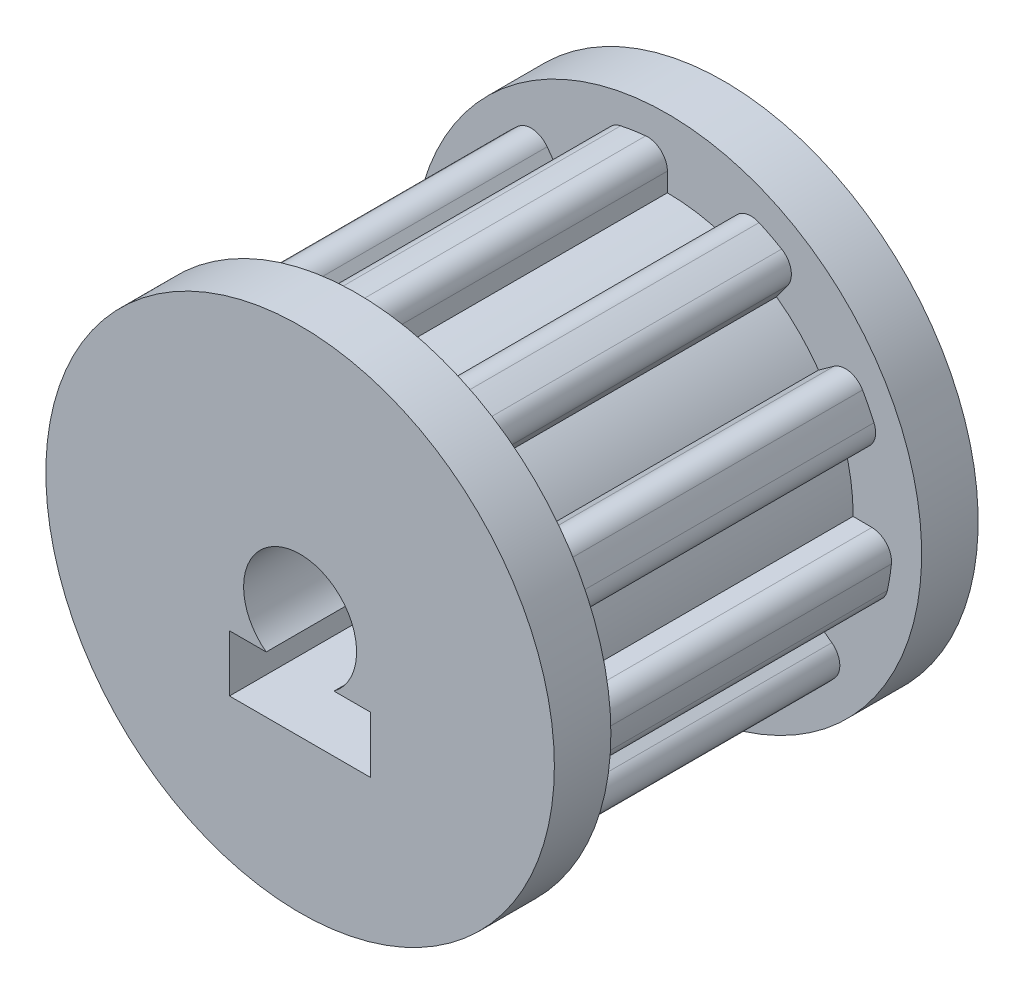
ISO-10303-21;
HEADER;
FILE_DESCRIPTION(('STEP AP214'),'2;1');
FILE_NAME('part.step','',(''),(''),'','','');
FILE_SCHEMA(('AUTOMOTIVE_DESIGN { 1 0 10303 214 1 1 1 1 }'));
ENDSEC;
DATA;
#1=APPLICATION_CONTEXT('core data for automotive mechanical design processes');
#2=APPLICATION_PROTOCOL_DEFINITION('international standard','automotive_design',2000,#1);
#3=PRODUCT_CONTEXT('',#1,'mechanical');
#4=PRODUCT('Part','Part','',(#3));
#5=PRODUCT_RELATED_PRODUCT_CATEGORY('part','',(#4));
#6=PRODUCT_DEFINITION_FORMATION('','',#4);
#7=PRODUCT_DEFINITION_CONTEXT('part definition',#1,'design');
#8=PRODUCT_DEFINITION('design','',#6,#7);
#9=PRODUCT_DEFINITION_SHAPE('','',#8);
#10=(LENGTH_UNIT() NAMED_UNIT(*) SI_UNIT(.MILLI.,.METRE.));
#11=(NAMED_UNIT(*) PLANE_ANGLE_UNIT() SI_UNIT($,.RADIAN.));
#12=(NAMED_UNIT(*) SI_UNIT($,.STERADIAN.) SOLID_ANGLE_UNIT());
#13=UNCERTAINTY_MEASURE_WITH_UNIT(LENGTH_MEASURE(1.E-05),#10,'distance_accuracy_value','');
#14=(GEOMETRIC_REPRESENTATION_CONTEXT(3) GLOBAL_UNCERTAINTY_ASSIGNED_CONTEXT((#13)) GLOBAL_UNIT_ASSIGNED_CONTEXT((#10,
#11,#12)) REPRESENTATION_CONTEXT('',''));
#15=CARTESIAN_POINT('',(0.,0.,0.));
#16=DIRECTION('',(0.,0.,1.));
#17=DIRECTION('',(1.,0.,0.));
#18=AXIS2_PLACEMENT_3D('',#15,#16,#17);
#19=CARTESIAN_POINT('',(0.,0.,11.));
#20=DIRECTION('',(0.,0.,-1.));
#21=DIRECTION('',(-1.,0.,0.));
#22=AXIS2_PLACEMENT_3D('',#19,#20,#21);
#23=CYLINDRICAL_SURFACE('',#22,6.57361123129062);
#24=CARTESIAN_POINT('',(0.,0.,0.));
#25=DIRECTION('',(0.,0.,-1.));
#26=DIRECTION('',(-1.,0.,0.));
#27=AXIS2_PLACEMENT_3D('',#24,#25,#26);
#28=CIRCLE('',#27,6.57361123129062);
#29=CARTESIAN_POINT('',(-3.86387173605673,5.31816320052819,0.));
#30=VERTEX_POINT('',#29);
#31=CARTESIAN_POINT('',(-1.97672302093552,6.26936445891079,0.));
#32=VERTEX_POINT('',#31);
#33=EDGE_CURVE('E685',#30,#32,#28,.T.);
#34=ORIENTED_EDGE('',*,*,#33,.F.);
#35=DIRECTION('',(0.,0.,-1.));
#36=VECTOR('',#35,1.);
#37=CARTESIAN_POINT('',(-3.86387173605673,5.31816320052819,11.));
#38=LINE('',#37,#36);
#39=CARTESIAN_POINT('',(-3.86387173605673,5.31816320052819,11.));
#40=VERTEX_POINT('',#39);
#41=EDGE_CURVE('E523',#40,#30,#38,.T.);
#42=ORIENTED_EDGE('',*,*,#41,.F.);
#43=CARTESIAN_POINT('',(0.,0.,11.));
#44=DIRECTION('',(0.,0.,-1.));
#45=DIRECTION('',(-1.,0.,0.));
#46=AXIS2_PLACEMENT_3D('',#43,#44,#45);
#47=CIRCLE('',#46,6.57361123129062);
#48=CARTESIAN_POINT('',(-1.97672302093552,6.26936445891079,11.));
#49=VERTEX_POINT('',#48);
#50=EDGE_CURVE('E691',#40,#49,#47,.T.);
#51=ORIENTED_EDGE('',*,*,#50,.T.);
#52=DIRECTION('',(0.,0.,-1.));
#53=VECTOR('',#52,1.);
#54=CARTESIAN_POINT('',(-1.97672302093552,6.26936445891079,11.));
#55=LINE('',#54,#53);
#56=EDGE_CURVE('E706',#49,#32,#55,.T.);
#57=ORIENTED_EDGE('',*,*,#56,.T.);
#58=EDGE_LOOP('',(#34,#42,#51,#57));
#59=FACE_BOUND('',#58,.T.);
#60=ADVANCED_FACE('F32',(#59),#23,.T.);
#61=CARTESIAN_POINT('',(-6.25187579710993,2.0313575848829,11.));
#62=VERTEX_POINT('',#61);
#63=CARTESIAN_POINT('',(-5.28424248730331,3.91013375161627,11.));
#64=VERTEX_POINT('',#63);
#65=EDGE_CURVE('E1221',#62,#64,#47,.T.);
#66=ORIENTED_EDGE('',*,*,#65,.T.);
#67=DIRECTION('',(0.,0.,-1.));
#68=VECTOR('',#67,1.);
#69=CARTESIAN_POINT('',(-5.28424248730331,3.91013375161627,11.));
#70=LINE('',#69,#68);
#71=CARTESIAN_POINT('',(-5.28424248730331,3.91013375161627,0.));
#72=VERTEX_POINT('',#71);
#73=EDGE_CURVE('E516',#64,#72,#70,.T.);
#74=ORIENTED_EDGE('',*,*,#73,.T.);
#75=CARTESIAN_POINT('',(-6.25187579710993,2.0313575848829,0.));
#76=VERTEX_POINT('',#75);
#77=EDGE_CURVE('E1026',#76,#72,#28,.T.);
#78=ORIENTED_EDGE('',*,*,#77,.F.);
#79=DIRECTION('',(0.,0.,-1.));
#80=VECTOR('',#79,1.);
#81=CARTESIAN_POINT('',(-6.25187579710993,2.0313575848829,11.));
#82=LINE('',#81,#80);
#83=EDGE_CURVE('E543',#62,#76,#82,.T.);
#84=ORIENTED_EDGE('',*,*,#83,.F.);
#85=EDGE_LOOP('',(#66,#74,#78,#84));
#86=FACE_BOUND('',#85,.T.);
#87=ADVANCED_FACE('F964',(#86),#23,.T.);
#88=CARTESIAN_POINT('',(-6.25187579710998,-2.03135758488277,11.));
#89=VERTEX_POINT('',#88);
#90=CARTESIAN_POINT('',(-6.57336092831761,0.0573648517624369,11.));
#91=VERTEX_POINT('',#90);
#92=EDGE_CURVE('E1199',#89,#91,#47,.T.);
#93=ORIENTED_EDGE('',*,*,#92,.T.);
#94=DIRECTION('',(0.,0.,-1.));
#95=VECTOR('',#94,1.);
#96=CARTESIAN_POINT('',(-6.57336092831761,0.0573648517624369,11.));
#97=LINE('',#96,#95);
#98=CARTESIAN_POINT('',(-6.57336092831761,0.0573648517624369,0.));
#99=VERTEX_POINT('',#98);
#100=EDGE_CURVE('E536',#91,#99,#97,.T.);
#101=ORIENTED_EDGE('',*,*,#100,.T.);
#102=CARTESIAN_POINT('',(-6.25187579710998,-2.03135758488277,0.));
#103=VERTEX_POINT('',#102);
#104=EDGE_CURVE('E1028',#103,#99,#28,.T.);
#105=ORIENTED_EDGE('',*,*,#104,.F.);
#106=DIRECTION('',(0.,0.,-1.));
#107=VECTOR('',#106,1.);
#108=CARTESIAN_POINT('',(-6.25187579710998,-2.03135758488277,11.));
#109=LINE('',#108,#107);
#110=EDGE_CURVE('E563',#89,#103,#109,.T.);
#111=ORIENTED_EDGE('',*,*,#110,.F.);
#112=EDGE_LOOP('',(#93,#101,#105,#111));
#113=FACE_BOUND('',#112,.T.);
#114=ADVANCED_FACE('F971',(#113),#23,.T.);
#115=CARTESIAN_POINT('',(-3.86387173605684,-5.31816320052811,11.));
#116=VERTEX_POINT('',#115);
#117=CARTESIAN_POINT('',(-5.35167891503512,-3.81731547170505,11.));
#118=VERTEX_POINT('',#117);
#119=EDGE_CURVE('E1176',#116,#118,#47,.T.);
#120=ORIENTED_EDGE('',*,*,#119,.T.);
#121=DIRECTION('',(0.,0.,-1.));
#122=VECTOR('',#121,1.);
#123=CARTESIAN_POINT('',(-5.35167891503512,-3.81731547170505,11.));
#124=LINE('',#123,#122);
#125=CARTESIAN_POINT('',(-5.35167891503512,-3.81731547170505,0.));
#126=VERTEX_POINT('',#125);
#127=EDGE_CURVE('E556',#118,#126,#124,.T.);
#128=ORIENTED_EDGE('',*,*,#127,.T.);
#129=CARTESIAN_POINT('',(-3.86387173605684,-5.3181632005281,0.));
#130=VERTEX_POINT('',#129);
#131=EDGE_CURVE('E1033',#130,#126,#28,.T.);
#132=ORIENTED_EDGE('',*,*,#131,.F.);
#133=DIRECTION('',(0.,0.,-1.));
#134=VECTOR('',#133,1.);
#135=CARTESIAN_POINT('',(-3.86387173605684,-5.31816320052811,11.));
#136=LINE('',#135,#134);
#137=EDGE_CURVE('E583',#116,#130,#136,.T.);
#138=ORIENTED_EDGE('',*,*,#137,.F.);
#139=EDGE_LOOP('',(#120,#128,#132,#138));
#140=FACE_BOUND('',#139,.T.);
#141=ADVANCED_FACE('F1181',(#140),#23,.T.);
#142=CARTESIAN_POINT('',(0.,-6.57361123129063,11.));
#143=VERTEX_POINT('',#142);
#144=CARTESIAN_POINT('',(-2.08583745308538,-6.23391103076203,11.));
#145=VERTEX_POINT('',#144);
#146=EDGE_CURVE('E1153',#143,#145,#47,.T.);
#147=ORIENTED_EDGE('',*,*,#146,.T.);
#148=DIRECTION('',(0.,0.,-1.));
#149=VECTOR('',#148,1.);
#150=CARTESIAN_POINT('',(-2.08583745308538,-6.23391103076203,11.));
#151=LINE('',#150,#149);
#152=CARTESIAN_POINT('',(-2.08583745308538,-6.23391103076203,0.));
#153=VERTEX_POINT('',#152);
#154=EDGE_CURVE('E576',#145,#153,#151,.T.);
#155=ORIENTED_EDGE('',*,*,#154,.T.);
#156=CARTESIAN_POINT('',(0.,-6.57361123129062,0.));
#157=VERTEX_POINT('',#156);
#158=EDGE_CURVE('E1038',#157,#153,#28,.T.);
#159=ORIENTED_EDGE('',*,*,#158,.F.);
#160=DIRECTION('',(0.,0.,-1.));
#161=VECTOR('',#160,1.);
#162=CARTESIAN_POINT('',(0.,-6.57361123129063,11.));
#163=LINE('',#162,#161);
#164=EDGE_CURVE('E603',#143,#157,#163,.T.);
#165=ORIENTED_EDGE('',*,*,#164,.F.);
#166=EDGE_LOOP('',(#147,#155,#159,#165));
#167=FACE_BOUND('',#166,.T.);
#168=ADVANCED_FACE('F1158',(#167),#23,.T.);
#169=CARTESIAN_POINT('',(3.86387173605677,-5.31816320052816,11.));
#170=VERTEX_POINT('',#169);
#171=CARTESIAN_POINT('',(1.97672302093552,-6.26936445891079,11.));
#172=VERTEX_POINT('',#171);
#173=EDGE_CURVE('E1130',#170,#172,#47,.T.);
#174=ORIENTED_EDGE('',*,*,#173,.T.);
#175=DIRECTION('',(0.,0.,-1.));
#176=VECTOR('',#175,1.);
#177=CARTESIAN_POINT('',(1.97672302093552,-6.26936445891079,11.));
#178=LINE('',#177,#176);
#179=CARTESIAN_POINT('',(1.97672302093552,-6.26936445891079,0.));
#180=VERTEX_POINT('',#179);
#181=EDGE_CURVE('E596',#172,#180,#178,.T.);
#182=ORIENTED_EDGE('',*,*,#181,.T.);
#183=CARTESIAN_POINT('',(3.86387173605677,-5.31816320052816,0.));
#184=VERTEX_POINT('',#183);
#185=EDGE_CURVE('E1043',#184,#180,#28,.T.);
#186=ORIENTED_EDGE('',*,*,#185,.F.);
#187=DIRECTION('',(0.,0.,-1.));
#188=VECTOR('',#187,1.);
#189=CARTESIAN_POINT('',(3.86387173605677,-5.31816320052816,11.));
#190=LINE('',#189,#188);
#191=EDGE_CURVE('E623',#170,#184,#190,.T.);
#192=ORIENTED_EDGE('',*,*,#191,.F.);
#193=EDGE_LOOP('',(#174,#182,#186,#192));
#194=FACE_BOUND('',#193,.T.);
#195=ADVANCED_FACE('F1135',(#194),#23,.T.);
#196=CARTESIAN_POINT('',(6.25187579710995,-2.03135758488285,11.));
#197=VERTEX_POINT('',#196);
#198=CARTESIAN_POINT('',(5.28424248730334,-3.91013375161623,11.));
#199=VERTEX_POINT('',#198);
#200=EDGE_CURVE('E1107',#197,#199,#47,.T.);
#201=ORIENTED_EDGE('',*,*,#200,.T.);
#202=DIRECTION('',(0.,0.,-1.));
#203=VECTOR('',#202,1.);
#204=CARTESIAN_POINT('',(5.28424248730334,-3.91013375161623,11.));
#205=LINE('',#204,#203);
#206=CARTESIAN_POINT('',(5.28424248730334,-3.91013375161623,0.));
#207=VERTEX_POINT('',#206);
#208=EDGE_CURVE('E616',#199,#207,#205,.T.);
#209=ORIENTED_EDGE('',*,*,#208,.T.);
#210=CARTESIAN_POINT('',(6.25187579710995,-2.03135758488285,0.));
#211=VERTEX_POINT('',#210);
#212=EDGE_CURVE('E1048',#211,#207,#28,.T.);
#213=ORIENTED_EDGE('',*,*,#212,.F.);
#214=DIRECTION('',(0.,0.,-1.));
#215=VECTOR('',#214,1.);
#216=CARTESIAN_POINT('',(6.25187579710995,-2.03135758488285,11.));
#217=LINE('',#216,#215);
#218=EDGE_CURVE('E643',#197,#211,#217,.T.);
#219=ORIENTED_EDGE('',*,*,#218,.F.);
#220=EDGE_LOOP('',(#201,#209,#213,#219));
#221=FACE_BOUND('',#220,.T.);
#222=ADVANCED_FACE('F1112',(#221),#23,.T.);
#223=CARTESIAN_POINT('',(6.25187579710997,2.03135758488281,11.));
#224=VERTEX_POINT('',#223);
#225=CARTESIAN_POINT('',(6.57336092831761,-0.0573648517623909,11.));
#226=VERTEX_POINT('',#225);
#227=EDGE_CURVE('E1089',#224,#226,#47,.T.);
#228=ORIENTED_EDGE('',*,*,#227,.T.);
#229=DIRECTION('',(0.,0.,-1.));
#230=VECTOR('',#229,1.);
#231=CARTESIAN_POINT('',(6.57336092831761,-0.0573648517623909,11.));
#232=LINE('',#231,#230);
#233=CARTESIAN_POINT('',(6.57336092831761,-0.0573648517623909,0.));
#234=VERTEX_POINT('',#233);
#235=EDGE_CURVE('E636',#226,#234,#232,.T.);
#236=ORIENTED_EDGE('',*,*,#235,.T.);
#237=CARTESIAN_POINT('',(6.25187579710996,2.03135758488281,0.));
#238=VERTEX_POINT('',#237);
#239=EDGE_CURVE('E1053',#238,#234,#28,.T.);
#240=ORIENTED_EDGE('',*,*,#239,.F.);
#241=DIRECTION('',(0.,0.,-1.));
#242=VECTOR('',#241,1.);
#243=CARTESIAN_POINT('',(6.25187579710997,2.03135758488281,11.));
#244=LINE('',#243,#242);
#245=EDGE_CURVE('E663',#224,#238,#244,.T.);
#246=ORIENTED_EDGE('',*,*,#245,.F.);
#247=EDGE_LOOP('',(#228,#236,#240,#246));
#248=FACE_BOUND('',#247,.T.);
#249=ADVANCED_FACE('F987',(#248),#23,.T.);
#250=CARTESIAN_POINT('',(3.8638717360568,5.31816320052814,11.));
#251=VERTEX_POINT('',#250);
#252=CARTESIAN_POINT('',(5.3516789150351,3.81731547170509,11.));
#253=VERTEX_POINT('',#252);
#254=EDGE_CURVE('E690',#251,#253,#47,.T.);
#255=ORIENTED_EDGE('',*,*,#254,.T.);
#256=DIRECTION('',(0.,0.,-1.));
#257=VECTOR('',#256,1.);
#258=CARTESIAN_POINT('',(5.3516789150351,3.81731547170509,11.));
#259=LINE('',#258,#257);
#260=CARTESIAN_POINT('',(5.3516789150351,3.81731547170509,0.));
#261=VERTEX_POINT('',#260);
#262=EDGE_CURVE('E656',#253,#261,#259,.T.);
#263=ORIENTED_EDGE('',*,*,#262,.T.);
#264=CARTESIAN_POINT('',(3.8638717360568,5.31816320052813,0.));
#265=VERTEX_POINT('',#264);
#266=EDGE_CURVE('E695',#265,#261,#28,.T.);
#267=ORIENTED_EDGE('',*,*,#266,.F.);
#268=DIRECTION('',(0.,0.,-1.));
#269=VECTOR('',#268,1.);
#270=CARTESIAN_POINT('',(3.8638717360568,5.31816320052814,11.));
#271=LINE('',#270,#269);
#272=EDGE_CURVE('E683',#251,#265,#271,.T.);
#273=ORIENTED_EDGE('',*,*,#272,.F.);
#274=EDGE_LOOP('',(#255,#263,#267,#273));
#275=FACE_BOUND('',#274,.T.);
#276=ADVANCED_FACE('F978',(#275),#23,.T.);
#277=CARTESIAN_POINT('',(0.,6.57361123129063,11.));
#278=VERTEX_POINT('',#277);
#279=CARTESIAN_POINT('',(2.08583745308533,6.23391103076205,11.));
#280=VERTEX_POINT('',#279);
#281=EDGE_CURVE('E686',#278,#280,#47,.T.);
#282=ORIENTED_EDGE('',*,*,#281,.T.);
#283=DIRECTION('',(0.,0.,-1.));
#284=VECTOR('',#283,1.);
#285=CARTESIAN_POINT('',(2.08583745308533,6.23391103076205,11.));
#286=LINE('',#285,#284);
#287=CARTESIAN_POINT('',(2.08583745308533,6.23391103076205,0.));
#288=VERTEX_POINT('',#287);
#289=EDGE_CURVE('E676',#280,#288,#286,.T.);
#290=ORIENTED_EDGE('',*,*,#289,.T.);
#291=CARTESIAN_POINT('',(0.,6.57361123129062,0.));
#292=VERTEX_POINT('',#291);
#293=EDGE_CURVE('E692',#292,#288,#28,.T.);
#294=ORIENTED_EDGE('',*,*,#293,.F.);
#295=DIRECTION('',(0.,0.,-1.));
#296=VECTOR('',#295,1.);
#297=CARTESIAN_POINT('',(0.,6.57361123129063,11.));
#298=LINE('',#297,#296);
#299=EDGE_CURVE('E713',#278,#292,#298,.T.);
#300=ORIENTED_EDGE('',*,*,#299,.F.);
#301=EDGE_LOOP('',(#282,#290,#294,#300));
#302=FACE_BOUND('',#301,.T.);
#303=ADVANCED_FACE('F967',(#302),#23,.T.);
#304=CARTESIAN_POINT('',(0.,7.97361123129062,11.));
#305=DIRECTION('',(-1.,0.,0.));
#306=DIRECTION('',(0.,-1.,0.));
#307=AXIS2_PLACEMENT_3D('',#304,#305,#306);
#308=PLANE('',#307);
#309=DIRECTION('',(0.,1.,0.));
#310=VECTOR('',#309,1.);
#311=CARTESIAN_POINT('',(0.,7.97361123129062,0.));
#312=LINE('',#311,#310);
#313=CARTESIAN_POINT('',(0.,7.23984946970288,0.));
#314=VERTEX_POINT('',#313);
#315=EDGE_CURVE('E689',#292,#314,#312,.T.);
#316=ORIENTED_EDGE('',*,*,#315,.T.);
#317=DIRECTION('',(0.,0.,-1.));
#318=VECTOR('',#317,1.);
#319=CARTESIAN_POINT('',(0.,7.23984946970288,11.));
#320=LINE('',#319,#318);
#321=CARTESIAN_POINT('',(0.,7.23984946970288,11.));
#322=VERTEX_POINT('',#321);
#323=EDGE_CURVE('E735',#314,#322,#320,.F.);
#324=ORIENTED_EDGE('',*,*,#323,.T.);
#325=DIRECTION('',(0.,1.,0.));
#326=VECTOR('',#325,1.);
#327=CARTESIAN_POINT('',(0.,7.97361123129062,11.));
#328=LINE('',#327,#326);
#329=EDGE_CURVE('E696',#278,#322,#328,.T.);
#330=ORIENTED_EDGE('',*,*,#329,.F.);
#331=ORIENTED_EDGE('',*,*,#299,.T.);
#332=EDGE_LOOP('',(#316,#324,#330,#331));
#333=FACE_BOUND('',#332,.T.);
#334=ADVANCED_FACE('F977',(#333),#308,.F.);
#335=CARTESIAN_POINT('',(0.,0.,11.));
#336=DIRECTION('',(0.,0.,-1.));
#337=DIRECTION('',(-1.,0.,0.));
#338=AXIS2_PLACEMENT_3D('',#335,#336,#337);
#339=CYLINDRICAL_SURFACE('',#338,7.97361123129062);
#340=CARTESIAN_POINT('',(0.,0.,0.));
#341=DIRECTION('',(0.,0.,1.));
#342=DIRECTION('',(1.,0.,0.));
#343=AXIS2_PLACEMENT_3D('',#340,#341,#342);
#344=CIRCLE('',#343,7.97361123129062);
#345=CARTESIAN_POINT('',(-0.767366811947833,7.93660029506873,0.));
#346=VERTEX_POINT('',#345);
#347=CARTESIAN_POINT('',(-1.65473100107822,7.80002188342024,0.));
#348=VERTEX_POINT('',#347);
#349=EDGE_CURVE('E708',#346,#348,#344,.T.);
#350=ORIENTED_EDGE('',*,*,#349,.T.);
#351=DIRECTION('',(0.,0.,-1.));
#352=VECTOR('',#351,1.);
#353=CARTESIAN_POINT('',(-1.65473100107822,7.80002188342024,11.));
#354=LINE('',#353,#352);
#355=CARTESIAN_POINT('',(-1.65473100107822,7.80002188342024,11.));
#356=VERTEX_POINT('',#355);
#357=EDGE_CURVE('E727',#348,#356,#354,.F.);
#358=ORIENTED_EDGE('',*,*,#357,.T.);
#359=CARTESIAN_POINT('',(0.,0.,11.));
#360=DIRECTION('',(0.,0.,1.));
#361=DIRECTION('',(1.,0.,0.));
#362=AXIS2_PLACEMENT_3D('',#359,#360,#361);
#363=CIRCLE('',#362,7.97361123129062);
#364=CARTESIAN_POINT('',(-0.767366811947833,7.93660029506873,11.));
#365=VERTEX_POINT('',#364);
#366=EDGE_CURVE('E699',#365,#356,#363,.T.);
#367=ORIENTED_EDGE('',*,*,#366,.F.);
#368=DIRECTION('',(0.,0.,-1.));
#369=VECTOR('',#368,1.);
#370=CARTESIAN_POINT('',(-0.767366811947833,7.93660029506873,11.));
#371=LINE('',#370,#369);
#372=EDGE_CURVE('E724',#365,#346,#371,.T.);
#373=ORIENTED_EDGE('',*,*,#372,.T.);
#374=EDGE_LOOP('',(#350,#358,#367,#373));
#375=FACE_BOUND('',#374,.T.);
#376=ADVANCED_FACE('F984',(#375),#339,.T.);
#377=CARTESIAN_POINT('',(-2.3977111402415,7.60456818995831,11.));
#378=DIRECTION('',(0.953716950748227,0.300705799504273,0.));
#379=DIRECTION('',(-0.300705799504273,0.953716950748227,0.));
#380=AXIS2_PLACEMENT_3D('',#377,#378,#379);
#381=PLANE('',#380);
#382=DIRECTION('',(0.300705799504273,-0.953716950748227,0.));
#383=VECTOR('',#382,1.);
#384=CARTESIAN_POINT('',(-2.3977111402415,7.60456818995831,11.));
#385=LINE('',#384,#383);
#386=CARTESIAN_POINT('',(-2.1770647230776,6.9047671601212,11.));
#387=VERTEX_POINT('',#386);
#388=EDGE_CURVE('E703',#387,#49,#385,.T.);
#389=ORIENTED_EDGE('',*,*,#388,.F.);
#390=DIRECTION('',(0.,0.,-1.));
#391=VECTOR('',#390,1.);
#392=CARTESIAN_POINT('',(-2.1770647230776,6.9047671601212,11.));
#393=LINE('',#392,#391);
#394=CARTESIAN_POINT('',(-2.1770647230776,6.9047671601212,0.));
#395=VERTEX_POINT('',#394);
#396=EDGE_CURVE('E715',#387,#395,#393,.T.);
#397=ORIENTED_EDGE('',*,*,#396,.T.);
#398=DIRECTION('',(0.300705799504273,-0.953716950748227,0.));
#399=VECTOR('',#398,1.);
#400=CARTESIAN_POINT('',(-2.3977111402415,7.60456818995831,0.));
#401=LINE('',#400,#399);
#402=EDGE_CURVE('E700',#395,#32,#401,.T.);
#403=ORIENTED_EDGE('',*,*,#402,.T.);
#404=ORIENTED_EDGE('',*,*,#56,.F.);
#405=EDGE_LOOP('',(#389,#397,#403,#404));
#406=FACE_BOUND('',#405,.T.);
#407=ADVANCED_FACE('F1021',(#406),#381,.F.);
#408=CARTESIAN_POINT('',(-1.50946285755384,7.11526121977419,11.));
#409=DIRECTION('',(0.,0.,-1.));
#410=DIRECTION('',(-1.,0.,0.));
#411=AXIS2_PLACEMENT_3D('',#408,#409,#410);
#412=CYLINDRICAL_SURFACE('',#411,0.7);
#413=CARTESIAN_POINT('',(-1.50946285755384,7.11526121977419,11.));
#414=DIRECTION('',(0.,0.,1.));
#415=DIRECTION('',(1.,0.,0.));
#416=AXIS2_PLACEMENT_3D('',#413,#414,#415);
#417=CIRCLE('',#416,0.7);
#418=EDGE_CURVE('E732',#356,#387,#417,.T.);
#419=ORIENTED_EDGE('',*,*,#418,.F.);
#420=ORIENTED_EDGE('',*,*,#357,.F.);
#421=CARTESIAN_POINT('',(-1.50946285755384,7.11526121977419,0.));
#422=DIRECTION('',(0.,0.,1.));
#423=DIRECTION('',(1.,0.,0.));
#424=AXIS2_PLACEMENT_3D('',#421,#422,#423);
#425=CIRCLE('',#424,0.7);
#426=EDGE_CURVE('E721',#395,#348,#425,.F.);
#427=ORIENTED_EDGE('',*,*,#426,.F.);
#428=ORIENTED_EDGE('',*,*,#396,.F.);
#429=EDGE_LOOP('',(#419,#420,#427,#428));
#430=FACE_BOUND('',#429,.T.);
#431=ADVANCED_FACE('F1018',(#430),#412,.T.);
#432=CARTESIAN_POINT('',(-0.7,7.23984946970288,11.));
#433=DIRECTION('',(0.,0.,-1.));
#434=DIRECTION('',(-1.,0.,0.));
#435=AXIS2_PLACEMENT_3D('',#432,#433,#434);
#436=CYLINDRICAL_SURFACE('',#435,0.7);
#437=CARTESIAN_POINT('',(-0.7,7.23984946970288,11.));
#438=DIRECTION('',(0.,0.,1.));
#439=DIRECTION('',(1.,0.,0.));
#440=AXIS2_PLACEMENT_3D('',#437,#438,#439);
#441=CIRCLE('',#440,0.7);
#442=EDGE_CURVE('E729',#322,#365,#441,.T.);
#443=ORIENTED_EDGE('',*,*,#442,.F.);
#444=ORIENTED_EDGE('',*,*,#323,.F.);
#445=CARTESIAN_POINT('',(-0.7,7.23984946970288,0.));
#446=DIRECTION('',(0.,0.,1.));
#447=DIRECTION('',(1.,0.,0.));
#448=AXIS2_PLACEMENT_3D('',#445,#446,#447);
#449=CIRCLE('',#448,0.7);
#450=EDGE_CURVE('E718',#346,#314,#449,.F.);
#451=ORIENTED_EDGE('',*,*,#450,.F.);
#452=ORIENTED_EDGE('',*,*,#372,.F.);
#453=EDGE_LOOP('',(#443,#444,#451,#452));
#454=FACE_BOUND('',#453,.T.);
#455=ADVANCED_FACE('F1011',(#454),#436,.T.);
#456=CARTESIAN_POINT('',(4.68677108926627,6.45078699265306,11.));
#457=DIRECTION('',(-0.809016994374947,0.587785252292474,0.));
#458=DIRECTION('',(-0.587785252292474,-0.809016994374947,0.));
#459=AXIS2_PLACEMENT_3D('',#456,#457,#458);
#460=PLANE('',#459);
#461=DIRECTION('',(0.587785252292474,0.809016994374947,0.));
#462=VECTOR('',#461,1.);
#463=CARTESIAN_POINT('',(4.68677108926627,6.45078699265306,0.));
#464=LINE('',#463,#462);
#465=CARTESIAN_POINT('',(4.25547674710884,5.85716125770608,0.));
#466=VERTEX_POINT('',#465);
#467=EDGE_CURVE('E665',#265,#466,#464,.T.);
#468=ORIENTED_EDGE('',*,*,#467,.T.);
#469=DIRECTION('',(0.,0.,-1.));
#470=VECTOR('',#469,1.);
#471=CARTESIAN_POINT('',(4.25547674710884,5.85716125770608,11.));
#472=LINE('',#471,#470);
#473=CARTESIAN_POINT('',(4.25547674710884,5.85716125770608,11.));
#474=VERTEX_POINT('',#473);
#475=EDGE_CURVE('E757',#466,#474,#472,.F.);
#476=ORIENTED_EDGE('',*,*,#475,.T.);
#477=DIRECTION('',(0.587785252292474,0.809016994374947,0.));
#478=VECTOR('',#477,1.);
#479=CARTESIAN_POINT('',(4.68677108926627,6.45078699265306,11.));
#480=LINE('',#479,#478);
#481=EDGE_CURVE('E666',#251,#474,#480,.T.);
#482=ORIENTED_EDGE('',*,*,#481,.F.);
#483=ORIENTED_EDGE('',*,*,#272,.T.);
#484=EDGE_LOOP('',(#468,#476,#482,#483));
#485=FACE_BOUND('',#484,.T.);
#486=ADVANCED_FACE('F1293',(#485),#460,.F.);
#487=CARTESIAN_POINT('',(0.,0.,11.));
#488=DIRECTION('',(0.,0.,-1.));
#489=DIRECTION('',(-1.,0.,0.));
#490=AXIS2_PLACEMENT_3D('',#487,#488,#489);
#491=CYLINDRICAL_SURFACE('',#490,7.97361123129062);
#492=CARTESIAN_POINT('',(0.,0.,0.));
#493=DIRECTION('',(0.,0.,1.));
#494=DIRECTION('',(0.809016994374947,-0.587785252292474,0.));
#495=AXIS2_PLACEMENT_3D('',#492,#493,#494);
#496=CIRCLE('',#495,7.97361123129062);
#497=CARTESIAN_POINT('',(4.04420381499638,6.87189141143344,0.));
#498=VERTEX_POINT('',#497);
#499=CARTESIAN_POINT('',(3.24603232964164,7.28297673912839,0.));
#500=VERTEX_POINT('',#499);
#501=EDGE_CURVE('E678',#498,#500,#496,.T.);
#502=ORIENTED_EDGE('',*,*,#501,.T.);
#503=DIRECTION('',(0.,0.,-1.));
#504=VECTOR('',#503,1.);
#505=CARTESIAN_POINT('',(3.24603232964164,7.28297673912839,11.));
#506=LINE('',#505,#504);
#507=CARTESIAN_POINT('',(3.24603232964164,7.28297673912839,11.));
#508=VERTEX_POINT('',#507);
#509=EDGE_CURVE('E749',#500,#508,#506,.F.);
#510=ORIENTED_EDGE('',*,*,#509,.T.);
#511=CARTESIAN_POINT('',(0.,0.,11.));
#512=DIRECTION('',(0.,0.,1.));
#513=DIRECTION('',(0.809016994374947,-0.587785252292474,0.));
#514=AXIS2_PLACEMENT_3D('',#511,#512,#513);
#515=CIRCLE('',#514,7.97361123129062);
#516=CARTESIAN_POINT('',(4.04420381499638,6.87189141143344,11.));
#517=VERTEX_POINT('',#516);
#518=EDGE_CURVE('E669',#517,#508,#515,.T.);
#519=ORIENTED_EDGE('',*,*,#518,.F.);
#520=DIRECTION('',(0.,0.,-1.));
#521=VECTOR('',#520,1.);
#522=CARTESIAN_POINT('',(4.04420381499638,6.87189141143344,11.));
#523=LINE('',#522,#521);
#524=EDGE_CURVE('E746',#517,#498,#523,.T.);
#525=ORIENTED_EDGE('',*,*,#524,.T.);
#526=EDGE_LOOP('',(#502,#510,#519,#525));
#527=FACE_BOUND('',#526,.T.);
#528=ADVANCED_FACE('F1291',(#527),#491,.T.);
#529=CARTESIAN_POINT('',(2.53006397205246,7.56156414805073,11.));
#530=DIRECTION('',(0.948323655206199,-0.317304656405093,0.));
#531=DIRECTION('',(0.317304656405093,0.948323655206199,0.));
#532=AXIS2_PLACEMENT_3D('',#529,#530,#531);
#533=PLANE('',#532);
#534=DIRECTION('',(-0.317304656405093,-0.948323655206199,0.));
#535=VECTOR('',#534,1.);
#536=CARTESIAN_POINT('',(2.53006397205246,7.56156414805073,11.));
#537=LINE('',#536,#535);
#538=CARTESIAN_POINT('',(2.29723794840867,6.8657205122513,11.));
#539=VERTEX_POINT('',#538);
#540=EDGE_CURVE('E673',#539,#280,#537,.T.);
#541=ORIENTED_EDGE('',*,*,#540,.F.);
#542=DIRECTION('',(0.,0.,-1.));
#543=VECTOR('',#542,1.);
#544=CARTESIAN_POINT('',(2.29723794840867,6.8657205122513,11.));
#545=LINE('',#544,#543);
#546=CARTESIAN_POINT('',(2.29723794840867,6.8657205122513,0.));
#547=VERTEX_POINT('',#546);
#548=EDGE_CURVE('E737',#539,#547,#545,.T.);
#549=ORIENTED_EDGE('',*,*,#548,.T.);
#550=DIRECTION('',(-0.317304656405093,-0.948323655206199,0.));
#551=VECTOR('',#550,1.);
#552=CARTESIAN_POINT('',(2.53006397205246,7.56156414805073,0.));
#553=LINE('',#552,#551);
#554=EDGE_CURVE('E670',#547,#288,#553,.T.);
#555=ORIENTED_EDGE('',*,*,#554,.T.);
#556=ORIENTED_EDGE('',*,*,#289,.F.);
#557=EDGE_LOOP('',(#541,#549,#555,#556));
#558=FACE_BOUND('',#557,.T.);
#559=ADVANCED_FACE('F997',(#558),#533,.F.);
#560=CARTESIAN_POINT('',(7.58335491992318,2.46398137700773,11.));
#561=DIRECTION('',(-0.309016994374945,0.951056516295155,0.));
#562=DIRECTION('',(-0.951056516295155,-0.309016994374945,0.));
#563=AXIS2_PLACEMENT_3D('',#560,#561,#562);
#564=PLANE('',#563);
#565=DIRECTION('',(0.951056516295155,0.309016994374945,0.));
#566=VECTOR('',#565,1.);
#567=CARTESIAN_POINT('',(7.58335491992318,2.46398137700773,0.));
#568=LINE('',#567,#566);
#569=CARTESIAN_POINT('',(6.88550601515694,2.23723652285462,0.));
#570=VERTEX_POINT('',#569);
#571=EDGE_CURVE('E645',#238,#570,#568,.T.);
#572=ORIENTED_EDGE('',*,*,#571,.T.);
#573=DIRECTION('',(0.,0.,-1.));
#574=VECTOR('',#573,1.);
#575=CARTESIAN_POINT('',(6.88550601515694,2.23723652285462,11.));
#576=LINE('',#575,#574);
#577=CARTESIAN_POINT('',(6.88550601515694,2.23723652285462,11.));
#578=VERTEX_POINT('',#577);
#579=EDGE_CURVE('E779',#570,#578,#576,.F.);
#580=ORIENTED_EDGE('',*,*,#579,.T.);
#581=DIRECTION('',(0.951056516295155,0.309016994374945,0.));
#582=VECTOR('',#581,1.);
#583=CARTESIAN_POINT('',(7.58335491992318,2.46398137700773,11.));
#584=LINE('',#583,#582);
#585=EDGE_CURVE('E646',#224,#578,#584,.T.);
#586=ORIENTED_EDGE('',*,*,#585,.F.);
#587=ORIENTED_EDGE('',*,*,#245,.T.);
#588=EDGE_LOOP('',(#572,#580,#586,#587));
#589=FACE_BOUND('',#588,.T.);
#590=ADVANCED_FACE('F1084',(#589),#564,.F.);
#591=CARTESIAN_POINT('',(0.,0.,11.));
#592=DIRECTION('',(0.,0.,-1.));
#593=DIRECTION('',(-1.,0.,0.));
#594=AXIS2_PLACEMENT_3D('',#591,#592,#593);
#595=CYLINDRICAL_SURFACE('',#594,7.97361123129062);
#596=CARTESIAN_POINT('',(0.,0.,0.));
#597=DIRECTION('',(0.,0.,1.));
#598=DIRECTION('',(0.309016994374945,-0.951056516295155,0.));
#599=AXIS2_PLACEMENT_3D('',#596,#597,#598);
#600=CIRCLE('',#599,7.97361123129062);
#601=CARTESIAN_POINT('',(7.31102604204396,3.18235357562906,0.));
#602=VERTEX_POINT('',#601);
#603=CARTESIAN_POINT('',(6.90692163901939,3.98408201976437,0.));
#604=VERTEX_POINT('',#603);
#605=EDGE_CURVE('E658',#602,#604,#600,.T.);
#606=ORIENTED_EDGE('',*,*,#605,.T.);
#607=DIRECTION('',(0.,0.,-1.));
#608=VECTOR('',#607,1.);
#609=CARTESIAN_POINT('',(6.90692163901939,3.98408201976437,11.));
#610=LINE('',#609,#608);
#611=CARTESIAN_POINT('',(6.90692163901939,3.98408201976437,11.));
#612=VERTEX_POINT('',#611);
#613=EDGE_CURVE('E771',#604,#612,#610,.F.);
#614=ORIENTED_EDGE('',*,*,#613,.T.);
#615=CARTESIAN_POINT('',(0.,0.,11.));
#616=DIRECTION('',(0.,0.,1.));
#617=DIRECTION('',(0.309016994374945,-0.951056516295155,0.));
#618=AXIS2_PLACEMENT_3D('',#615,#616,#617);
#619=CIRCLE('',#618,7.97361123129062);
#620=CARTESIAN_POINT('',(7.31102604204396,3.18235357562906,11.));
#621=VERTEX_POINT('',#620);
#622=EDGE_CURVE('E649',#621,#612,#619,.T.);
#623=ORIENTED_EDGE('',*,*,#622,.F.);
#624=DIRECTION('',(0.,0.,-1.));
#625=VECTOR('',#624,1.);
#626=CARTESIAN_POINT('',(7.31102604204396,3.18235357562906,11.));
#627=LINE('',#626,#625);
#628=EDGE_CURVE('E768',#621,#602,#627,.T.);
#629=ORIENTED_EDGE('',*,*,#628,.T.);
#630=EDGE_LOOP('',(#606,#614,#623,#629));
#631=FACE_BOUND('',#630,.T.);
#632=ADVANCED_FACE('F1078',(#631),#595,.T.);
#633=CARTESIAN_POINT('',(6.49144064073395,4.6302996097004,11.));
#634=DIRECTION('',(0.580702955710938,-0.814115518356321,0.));
#635=DIRECTION('',(0.814115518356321,0.580702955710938,0.));
#636=AXIS2_PLACEMENT_3D('',#633,#634,#635);
#637=PLANE('',#636);
#638=DIRECTION('',(-0.814115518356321,-0.580702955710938,0.));
#639=VECTOR('',#638,1.);
#640=CARTESIAN_POINT('',(6.49144064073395,4.6302996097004,11.));
#641=LINE('',#640,#639);
#642=CARTESIAN_POINT('',(5.89407380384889,4.20420198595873,11.));
#643=VERTEX_POINT('',#642);
#644=EDGE_CURVE('E653',#643,#253,#641,.T.);
#645=ORIENTED_EDGE('',*,*,#644,.F.);
#646=DIRECTION('',(0.,0.,-1.));
#647=VECTOR('',#646,1.);
#648=CARTESIAN_POINT('',(5.89407380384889,4.20420198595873,11.));
#649=LINE('',#648,#647);
#650=CARTESIAN_POINT('',(5.89407380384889,4.20420198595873,0.));
#651=VERTEX_POINT('',#650);
#652=EDGE_CURVE('E759',#643,#651,#649,.T.);
#653=ORIENTED_EDGE('',*,*,#652,.T.);
#654=DIRECTION('',(-0.814115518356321,-0.580702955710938,0.));
#655=VECTOR('',#654,1.);
#656=CARTESIAN_POINT('',(6.49144064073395,4.6302996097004,0.));
#657=LINE('',#656,#655);
#658=EDGE_CURVE('E650',#651,#261,#657,.T.);
#659=ORIENTED_EDGE('',*,*,#658,.T.);
#660=ORIENTED_EDGE('',*,*,#262,.F.);
#661=EDGE_LOOP('',(#645,#653,#659,#660));
#662=FACE_BOUND('',#661,.T.);
#663=ADVANCED_FACE('F1069',(#662),#637,.F.);
#664=CARTESIAN_POINT('',(7.58335491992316,-2.46398137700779,11.));
#665=DIRECTION('',(0.309016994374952,0.951056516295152,0.));
#666=DIRECTION('',(-0.951056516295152,0.309016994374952,0.));
#667=AXIS2_PLACEMENT_3D('',#664,#665,#666);
#668=PLANE('',#667);
#669=DIRECTION('',(0.951056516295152,-0.309016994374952,0.));
#670=VECTOR('',#669,1.);
#671=CARTESIAN_POINT('',(7.58335491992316,-2.46398137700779,0.));
#672=LINE('',#671,#670);
#673=CARTESIAN_POINT('',(6.88550601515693,-2.23723652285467,0.));
#674=VERTEX_POINT('',#673);
#675=EDGE_CURVE('E625',#211,#674,#672,.T.);
#676=ORIENTED_EDGE('',*,*,#675,.T.);
#677=DIRECTION('',(0.,0.,-1.));
#678=VECTOR('',#677,1.);
#679=CARTESIAN_POINT('',(6.88550601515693,-2.23723652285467,11.));
#680=LINE('',#679,#678);
#681=CARTESIAN_POINT('',(6.88550601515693,-2.23723652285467,11.));
#682=VERTEX_POINT('',#681);
#683=EDGE_CURVE('E801',#674,#682,#680,.F.);
#684=ORIENTED_EDGE('',*,*,#683,.T.);
#685=DIRECTION('',(0.951056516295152,-0.309016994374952,0.));
#686=VECTOR('',#685,1.);
#687=CARTESIAN_POINT('',(7.58335491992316,-2.46398137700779,11.));
#688=LINE('',#687,#686);
#689=EDGE_CURVE('E626',#197,#682,#688,.T.);
#690=ORIENTED_EDGE('',*,*,#689,.F.);
#691=ORIENTED_EDGE('',*,*,#218,.T.);
#692=EDGE_LOOP('',(#676,#684,#690,#691));
#693=FACE_BOUND('',#692,.T.);
#694=ADVANCED_FACE('F1110',(#693),#668,.F.);
#695=CARTESIAN_POINT('',(0.,0.,11.));
#696=DIRECTION('',(0.,0.,-1.));
#697=DIRECTION('',(-1.,0.,0.));
#698=AXIS2_PLACEMENT_3D('',#695,#696,#697);
#699=CYLINDRICAL_SURFACE('',#698,7.97361123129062);
#700=CARTESIAN_POINT('',(0.,0.,0.));
#701=DIRECTION('',(0.,0.,1.));
#702=DIRECTION('',(-0.309016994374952,-0.951056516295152,0.));
#703=AXIS2_PLACEMENT_3D('',#700,#701,#702);
#704=CIRCLE('',#703,7.97361123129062);
#705=CARTESIAN_POINT('',(7.78528481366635,-1.72273516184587,0.));
#706=VERTEX_POINT('',#705);
#707=CARTESIAN_POINT('',(7.92960163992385,-0.836596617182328,0.));
#708=VERTEX_POINT('',#707);
#709=EDGE_CURVE('E638',#706,#708,#704,.T.);
#710=ORIENTED_EDGE('',*,*,#709,.T.);
#711=DIRECTION('',(0.,0.,-1.));
#712=VECTOR('',#711,1.);
#713=CARTESIAN_POINT('',(7.92960163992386,-0.836596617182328,11.));
#714=LINE('',#713,#712);
#715=CARTESIAN_POINT('',(7.92960163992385,-0.836596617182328,11.));
#716=VERTEX_POINT('',#715);
#717=EDGE_CURVE('E793',#708,#716,#714,.F.);
#718=ORIENTED_EDGE('',*,*,#717,.T.);
#719=CARTESIAN_POINT('',(0.,0.,11.));
#720=DIRECTION('',(0.,0.,1.));
#721=DIRECTION('',(-0.309016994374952,-0.951056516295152,0.));
#722=AXIS2_PLACEMENT_3D('',#719,#720,#721);
#723=CIRCLE('',#722,7.97361123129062);
#724=CARTESIAN_POINT('',(7.78528481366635,-1.72273516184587,11.));
#725=VERTEX_POINT('',#724);
#726=EDGE_CURVE('E629',#725,#716,#723,.T.);
#727=ORIENTED_EDGE('',*,*,#726,.F.);
#728=DIRECTION('',(0.,0.,-1.));
#729=VECTOR('',#728,1.);
#730=CARTESIAN_POINT('',(7.78528481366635,-1.72273516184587,11.));
#731=LINE('',#730,#729);
#732=EDGE_CURVE('E790',#725,#706,#731,.T.);
#733=ORIENTED_EDGE('',*,*,#732,.T.);
#734=EDGE_LOOP('',(#710,#718,#727,#733));
#735=FACE_BOUND('',#734,.T.);
#736=ADVANCED_FACE('F1099',(#735),#699,.T.);
#737=CARTESIAN_POINT('',(7.97330762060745,-0.0695820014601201,11.));
#738=DIRECTION('',(-0.00872653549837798,-0.999961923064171,0.));
#739=DIRECTION('',(0.999961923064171,-0.00872653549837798,0.));
#740=AXIS2_PLACEMENT_3D('',#737,#738,#739);
#741=PLANE('',#740);
#742=DIRECTION('',(-0.999961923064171,0.00872653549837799,0.));
#743=VECTOR('',#742,1.);
#744=CARTESIAN_POINT('',(7.97330762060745,-0.0695820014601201,11.));
#745=LINE('',#744,#743);
#746=CARTESIAN_POINT('',(7.23957379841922,-0.0631788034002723,11.));
#747=VERTEX_POINT('',#746);
#748=EDGE_CURVE('E633',#747,#226,#745,.T.);
#749=ORIENTED_EDGE('',*,*,#748,.F.);
#750=DIRECTION('',(0.,0.,-1.));
#751=VECTOR('',#750,1.);
#752=CARTESIAN_POINT('',(7.23957379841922,-0.0631788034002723,11.));
#753=LINE('',#752,#751);
#754=CARTESIAN_POINT('',(7.23957379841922,-0.0631788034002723,0.));
#755=VERTEX_POINT('',#754);
#756=EDGE_CURVE('E781',#747,#755,#753,.T.);
#757=ORIENTED_EDGE('',*,*,#756,.T.);
#758=DIRECTION('',(-0.999961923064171,0.00872653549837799,0.));
#759=VECTOR('',#758,1.);
#760=CARTESIAN_POINT('',(7.97330762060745,-0.0695820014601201,0.));
#761=LINE('',#760,#759);
#762=EDGE_CURVE('E630',#755,#234,#761,.T.);
#763=ORIENTED_EDGE('',*,*,#762,.T.);
#764=ORIENTED_EDGE('',*,*,#235,.F.);
#765=EDGE_LOOP('',(#749,#757,#763,#764));
#766=FACE_BOUND('',#765,.T.);
#767=ADVANCED_FACE('F1091',(#766),#741,.F.);
#768=CARTESIAN_POINT('',(4.68677108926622,-6.45078699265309,11.));
#769=DIRECTION('',(0.809016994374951,0.587785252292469,0.));
#770=DIRECTION('',(-0.587785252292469,0.809016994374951,0.));
#771=AXIS2_PLACEMENT_3D('',#768,#769,#770);
#772=PLANE('',#771);
#773=DIRECTION('',(0.587785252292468,-0.809016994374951,0.));
#774=VECTOR('',#773,1.);
#775=CARTESIAN_POINT('',(4.68677108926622,-6.45078699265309,0.));
#776=LINE('',#775,#774);
#777=CARTESIAN_POINT('',(4.2554767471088,-5.85716125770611,0.));
#778=VERTEX_POINT('',#777);
#779=EDGE_CURVE('E605',#184,#778,#776,.T.);
#780=ORIENTED_EDGE('',*,*,#779,.T.);
#781=DIRECTION('',(0.,0.,-1.));
#782=VECTOR('',#781,1.);
#783=CARTESIAN_POINT('',(4.2554767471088,-5.85716125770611,11.));
#784=LINE('',#783,#782);
#785=CARTESIAN_POINT('',(4.2554767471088,-5.85716125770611,11.));
#786=VERTEX_POINT('',#785);
#787=EDGE_CURVE('E823',#778,#786,#784,.F.);
#788=ORIENTED_EDGE('',*,*,#787,.T.);
#789=DIRECTION('',(0.587785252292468,-0.809016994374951,0.));
#790=VECTOR('',#789,1.);
#791=CARTESIAN_POINT('',(4.68677108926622,-6.45078699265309,11.));
#792=LINE('',#791,#790);
#793=EDGE_CURVE('E606',#170,#786,#792,.T.);
#794=ORIENTED_EDGE('',*,*,#793,.F.);
#795=ORIENTED_EDGE('',*,*,#191,.T.);
#796=EDGE_LOOP('',(#780,#788,#794,#795));
#797=FACE_BOUND('',#796,.T.);
#798=ADVANCED_FACE('F1133',(#797),#772,.F.);
#799=CARTESIAN_POINT('',(0.,0.,11.));
#800=DIRECTION('',(0.,0.,-1.));
#801=DIRECTION('',(-1.,0.,0.));
#802=AXIS2_PLACEMENT_3D('',#799,#800,#801);
#803=CYLINDRICAL_SURFACE('',#802,7.97361123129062);
#804=CARTESIAN_POINT('',(0.,0.,0.));
#805=DIRECTION('',(0.,0.,1.));
#806=DIRECTION('',(-0.809016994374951,-0.587785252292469,0.));
#807=AXIS2_PLACEMENT_3D('',#804,#805,#806);
#808=CIRCLE('',#807,7.97361123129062);
#809=CARTESIAN_POINT('',(5.28582939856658,-5.96979762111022,0.));
#810=VERTEX_POINT('',#809);
#811=CARTESIAN_POINT('',(5.9234433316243,-5.33772378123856,0.));
#812=VERTEX_POINT('',#811);
#813=EDGE_CURVE('E618',#810,#812,#808,.T.);
#814=ORIENTED_EDGE('',*,*,#813,.T.);
#815=DIRECTION('',(0.,0.,-1.));
#816=VECTOR('',#815,1.);
#817=CARTESIAN_POINT('',(5.9234433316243,-5.33772378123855,11.));
#818=LINE('',#817,#816);
#819=CARTESIAN_POINT('',(5.9234433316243,-5.33772378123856,11.));
#820=VERTEX_POINT('',#819);
#821=EDGE_CURVE('E815',#812,#820,#818,.F.);
#822=ORIENTED_EDGE('',*,*,#821,.T.);
#823=CARTESIAN_POINT('',(0.,0.,11.));
#824=DIRECTION('',(0.,0.,1.));
#825=DIRECTION('',(-0.809016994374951,-0.587785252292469,0.));
#826=AXIS2_PLACEMENT_3D('',#823,#824,#825);
#827=CIRCLE('',#826,7.97361123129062);
#828=CARTESIAN_POINT('',(5.28582939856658,-5.96979762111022,11.));
#829=VERTEX_POINT('',#828);
#830=EDGE_CURVE('E609',#829,#820,#827,.T.);
#831=ORIENTED_EDGE('',*,*,#830,.F.);
#832=DIRECTION('',(0.,0.,-1.));
#833=VECTOR('',#832,1.);
#834=CARTESIAN_POINT('',(5.28582939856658,-5.96979762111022,11.));
#835=LINE('',#834,#833);
#836=EDGE_CURVE('E812',#829,#810,#835,.T.);
#837=ORIENTED_EDGE('',*,*,#836,.T.);
#838=EDGE_LOOP('',(#814,#822,#831,#837));
#839=FACE_BOUND('',#838,.T.);
#840=ADVANCED_FACE('F1122',(#839),#803,.T.);
#841=CARTESIAN_POINT('',(6.40964209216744,-4.74288565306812,11.));
#842=DIRECTION('',(-0.594822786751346,-0.803856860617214,0.));
#843=DIRECTION('',(0.803856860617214,-0.594822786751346,0.));
#844=AXIS2_PLACEMENT_3D('',#841,#842,#843);
#845=PLANE('',#844);
#846=DIRECTION('',(-0.803856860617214,0.594822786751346,0.));
#847=VECTOR('',#846,1.);
#848=CARTESIAN_POINT('',(6.40964209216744,-4.74288565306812,11.));
#849=LINE('',#848,#847);
#850=CARTESIAN_POINT('',(5.81980266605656,-4.30642743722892,11.));
#851=VERTEX_POINT('',#850);
#852=EDGE_CURVE('E613',#851,#199,#849,.T.);
#853=ORIENTED_EDGE('',*,*,#852,.F.);
#854=DIRECTION('',(0.,0.,-1.));
#855=VECTOR('',#854,1.);
#856=CARTESIAN_POINT('',(5.81980266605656,-4.30642743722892,11.));
#857=LINE('',#856,#855);
#858=CARTESIAN_POINT('',(5.81980266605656,-4.30642743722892,0.));
#859=VERTEX_POINT('',#858);
#860=EDGE_CURVE('E803',#851,#859,#857,.T.);
#861=ORIENTED_EDGE('',*,*,#860,.T.);
#862=DIRECTION('',(-0.803856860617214,0.594822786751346,0.));
#863=VECTOR('',#862,1.);
#864=CARTESIAN_POINT('',(6.40964209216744,-4.74288565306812,0.));
#865=LINE('',#864,#863);
#866=EDGE_CURVE('E610',#859,#207,#865,.T.);
#867=ORIENTED_EDGE('',*,*,#866,.T.);
#868=ORIENTED_EDGE('',*,*,#208,.F.);
#869=EDGE_LOOP('',(#853,#861,#867,#868));
#870=FACE_BOUND('',#869,.T.);
#871=ADVANCED_FACE('F1114',(#870),#845,.F.);
#872=CARTESIAN_POINT('',(0.,-7.97361123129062,11.));
#873=DIRECTION('',(1.,0.,0.));
#874=DIRECTION('',(0.,1.,0.));
#875=AXIS2_PLACEMENT_3D('',#872,#873,#874);
#876=PLANE('',#875);
#877=DIRECTION('',(0.,-1.,0.));
#878=VECTOR('',#877,1.);
#879=CARTESIAN_POINT('',(0.,-7.97361123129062,0.));
#880=LINE('',#879,#878);
#881=CARTESIAN_POINT('',(0.,-7.23984946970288,0.));
#882=VERTEX_POINT('',#881);
#883=EDGE_CURVE('E585',#157,#882,#880,.T.);
#884=ORIENTED_EDGE('',*,*,#883,.T.);
#885=DIRECTION('',(0.,0.,-1.));
#886=VECTOR('',#885,1.);
#887=CARTESIAN_POINT('',(0.,-7.23984946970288,11.));
#888=LINE('',#887,#886);
#889=CARTESIAN_POINT('',(0.,-7.23984946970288,11.));
#890=VERTEX_POINT('',#889);
#891=EDGE_CURVE('E845',#882,#890,#888,.F.);
#892=ORIENTED_EDGE('',*,*,#891,.T.);
#893=DIRECTION('',(0.,-1.,0.));
#894=VECTOR('',#893,1.);
#895=CARTESIAN_POINT('',(0.,-7.97361123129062,11.));
#896=LINE('',#895,#894);
#897=EDGE_CURVE('E586',#143,#890,#896,.T.);
#898=ORIENTED_EDGE('',*,*,#897,.F.);
#899=ORIENTED_EDGE('',*,*,#164,.T.);
#900=EDGE_LOOP('',(#884,#892,#898,#899));
#901=FACE_BOUND('',#900,.T.);
#902=ADVANCED_FACE('F1156',(#901),#876,.F.);
#903=CARTESIAN_POINT('',(0.,0.,11.));
#904=DIRECTION('',(0.,0.,-1.));
#905=DIRECTION('',(-1.,0.,0.));
#906=AXIS2_PLACEMENT_3D('',#903,#904,#905);
#907=CYLINDRICAL_SURFACE('',#906,7.97361123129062);
#908=CARTESIAN_POINT('',(0.,0.,0.));
#909=DIRECTION('',(0.,0.,1.));
#910=DIRECTION('',(-1.,0.,0.));
#911=AXIS2_PLACEMENT_3D('',#908,#909,#910);
#912=CIRCLE('',#911,7.97361123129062);
#913=CARTESIAN_POINT('',(0.767366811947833,-7.93660029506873,0.));
#914=VERTEX_POINT('',#913);
#915=CARTESIAN_POINT('',(1.65473100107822,-7.80002188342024,0.));
#916=VERTEX_POINT('',#915);
#917=EDGE_CURVE('E598',#914,#916,#912,.T.);
#918=ORIENTED_EDGE('',*,*,#917,.T.);
#919=DIRECTION('',(0.,0.,-1.));
#920=VECTOR('',#919,1.);
#921=CARTESIAN_POINT('',(1.65473100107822,-7.80002188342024,11.));
#922=LINE('',#921,#920);
#923=CARTESIAN_POINT('',(1.65473100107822,-7.80002188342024,11.));
#924=VERTEX_POINT('',#923);
#925=EDGE_CURVE('E837',#916,#924,#922,.F.);
#926=ORIENTED_EDGE('',*,*,#925,.T.);
#927=CARTESIAN_POINT('',(0.,0.,11.));
#928=DIRECTION('',(0.,0.,1.));
#929=DIRECTION('',(-1.,0.,0.));
#930=AXIS2_PLACEMENT_3D('',#927,#928,#929);
#931=CIRCLE('',#930,7.97361123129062);
#932=CARTESIAN_POINT('',(0.767366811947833,-7.93660029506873,11.));
#933=VERTEX_POINT('',#932);
#934=EDGE_CURVE('E589',#933,#924,#931,.T.);
#935=ORIENTED_EDGE('',*,*,#934,.F.);
#936=DIRECTION('',(0.,0.,-1.));
#937=VECTOR('',#936,1.);
#938=CARTESIAN_POINT('',(0.767366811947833,-7.93660029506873,11.));
#939=LINE('',#938,#937);
#940=EDGE_CURVE('E834',#933,#914,#939,.T.);
#941=ORIENTED_EDGE('',*,*,#940,.T.);
#942=EDGE_LOOP('',(#918,#926,#935,#941));
#943=FACE_BOUND('',#942,.T.);
#944=ADVANCED_FACE('F1145',(#943),#907,.T.);
#945=CARTESIAN_POINT('',(2.3977111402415,-7.60456818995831,11.));
#946=DIRECTION('',(-0.953716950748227,-0.300705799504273,0.));
#947=DIRECTION('',(0.300705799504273,-0.953716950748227,0.));
#948=AXIS2_PLACEMENT_3D('',#945,#946,#947);
#949=PLANE('',#948);
#950=DIRECTION('',(-0.300705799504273,0.953716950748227,0.));
#951=VECTOR('',#950,1.);
#952=CARTESIAN_POINT('',(2.3977111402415,-7.60456818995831,11.));
#953=LINE('',#952,#951);
#954=CARTESIAN_POINT('',(2.1770647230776,-6.9047671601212,11.));
#955=VERTEX_POINT('',#954);
#956=EDGE_CURVE('E593',#955,#172,#953,.T.);
#957=ORIENTED_EDGE('',*,*,#956,.F.);
#958=DIRECTION('',(0.,0.,-1.));
#959=VECTOR('',#958,1.);
#960=CARTESIAN_POINT('',(2.1770647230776,-6.9047671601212,11.));
#961=LINE('',#960,#959);
#962=CARTESIAN_POINT('',(2.1770647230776,-6.9047671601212,0.));
#963=VERTEX_POINT('',#962);
#964=EDGE_CURVE('E825',#955,#963,#961,.T.);
#965=ORIENTED_EDGE('',*,*,#964,.T.);
#966=DIRECTION('',(-0.300705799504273,0.953716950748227,0.));
#967=VECTOR('',#966,1.);
#968=CARTESIAN_POINT('',(2.3977111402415,-7.60456818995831,0.));
#969=LINE('',#968,#967);
#970=EDGE_CURVE('E590',#963,#180,#969,.T.);
#971=ORIENTED_EDGE('',*,*,#970,.T.);
#972=ORIENTED_EDGE('',*,*,#181,.F.);
#973=EDGE_LOOP('',(#957,#965,#971,#972));
#974=FACE_BOUND('',#973,.T.);
#975=ADVANCED_FACE('F1137',(#974),#949,.F.);
#976=CARTESIAN_POINT('',(-4.68677108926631,-6.45078699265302,11.));
#977=DIRECTION('',(0.809016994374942,-0.58778525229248,0.));
#978=DIRECTION('',(0.58778525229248,0.809016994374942,0.));
#979=AXIS2_PLACEMENT_3D('',#976,#977,#978);
#980=PLANE('',#979);
#981=DIRECTION('',(-0.58778525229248,-0.809016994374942,0.));
#982=VECTOR('',#981,1.);
#983=CARTESIAN_POINT('',(-4.68677108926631,-6.45078699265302,0.));
#984=LINE('',#983,#982);
#985=CARTESIAN_POINT('',(-4.25547674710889,-5.85716125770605,0.));
#986=VERTEX_POINT('',#985);
#987=EDGE_CURVE('E565',#130,#986,#984,.T.);
#988=ORIENTED_EDGE('',*,*,#987,.T.);
#989=DIRECTION('',(0.,0.,-1.));
#990=VECTOR('',#989,1.);
#991=CARTESIAN_POINT('',(-4.25547674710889,-5.85716125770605,11.));
#992=LINE('',#991,#990);
#993=CARTESIAN_POINT('',(-4.25547674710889,-5.85716125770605,11.));
#994=VERTEX_POINT('',#993);
#995=EDGE_CURVE('E867',#986,#994,#992,.F.);
#996=ORIENTED_EDGE('',*,*,#995,.T.);
#997=DIRECTION('',(-0.58778525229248,-0.809016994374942,0.));
#998=VECTOR('',#997,1.);
#999=CARTESIAN_POINT('',(-4.68677108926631,-6.45078699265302,11.));
#1000=LINE('',#999,#998);
#1001=EDGE_CURVE('E566',#116,#994,#1000,.T.);
#1002=ORIENTED_EDGE('',*,*,#1001,.F.);
#1003=ORIENTED_EDGE('',*,*,#137,.T.);
#1004=EDGE_LOOP('',(#988,#996,#1002,#1003));
#1005=FACE_BOUND('',#1004,.T.);
#1006=ADVANCED_FACE('F1179',(#1005),#980,.F.);
#1007=CARTESIAN_POINT('',(0.,0.,11.));
#1008=DIRECTION('',(0.,0.,-1.));
#1009=DIRECTION('',(-1.,0.,0.));
#1010=AXIS2_PLACEMENT_3D('',#1007,#1008,#1009);
#1011=CYLINDRICAL_SURFACE('',#1010,7.97361123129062);
#1012=CARTESIAN_POINT('',(0.,0.,0.));
#1013=DIRECTION('',(0.,0.,1.));
#1014=DIRECTION('',(-0.809016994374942,0.58778525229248,0.));
#1015=AXIS2_PLACEMENT_3D('',#1012,#1013,#1014);
#1016=CIRCLE('',#1015,7.97361123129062);
#1017=CARTESIAN_POINT('',(-4.04420381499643,-6.87189141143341,0.));
#1018=VERTEX_POINT('',#1017);
#1019=CARTESIAN_POINT('',(-3.24603232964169,-7.28297673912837,0.));
#1020=VERTEX_POINT('',#1019);
#1021=EDGE_CURVE('E578',#1018,#1020,#1016,.T.);
#1022=ORIENTED_EDGE('',*,*,#1021,.T.);
#1023=DIRECTION('',(0.,0.,-1.));
#1024=VECTOR('',#1023,1.);
#1025=CARTESIAN_POINT('',(-3.24603232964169,-7.28297673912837,11.));
#1026=LINE('',#1025,#1024);
#1027=CARTESIAN_POINT('',(-3.24603232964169,-7.28297673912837,11.));
#1028=VERTEX_POINT('',#1027);
#1029=EDGE_CURVE('E859',#1020,#1028,#1026,.F.);
#1030=ORIENTED_EDGE('',*,*,#1029,.T.);
#1031=CARTESIAN_POINT('',(0.,0.,11.));
#1032=DIRECTION('',(0.,0.,1.));
#1033=DIRECTION('',(-0.809016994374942,0.58778525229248,0.));
#1034=AXIS2_PLACEMENT_3D('',#1031,#1032,#1033);
#1035=CIRCLE('',#1034,7.97361123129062);
#1036=CARTESIAN_POINT('',(-4.04420381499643,-6.87189141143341,11.));
#1037=VERTEX_POINT('',#1036);
#1038=EDGE_CURVE('E569',#1037,#1028,#1035,.T.);
#1039=ORIENTED_EDGE('',*,*,#1038,.F.);
#1040=DIRECTION('',(0.,0.,-1.));
#1041=VECTOR('',#1040,1.);
#1042=CARTESIAN_POINT('',(-4.04420381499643,-6.87189141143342,11.));
#1043=LINE('',#1042,#1041);
#1044=EDGE_CURVE('E856',#1037,#1018,#1043,.T.);
#1045=ORIENTED_EDGE('',*,*,#1044,.T.);
#1046=EDGE_LOOP('',(#1022,#1030,#1039,#1045));
#1047=FACE_BOUND('',#1046,.T.);
#1048=ADVANCED_FACE('F1168',(#1047),#1011,.T.);
#1049=CARTESIAN_POINT('',(-2.53006397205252,-7.56156414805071,11.));
#1050=DIRECTION('',(-0.948323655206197,0.3173046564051,0.));
#1051=DIRECTION('',(-0.3173046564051,-0.948323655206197,0.));
#1052=AXIS2_PLACEMENT_3D('',#1049,#1050,#1051);
#1053=PLANE('',#1052);
#1054=DIRECTION('',(0.3173046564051,0.948323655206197,0.));
#1055=VECTOR('',#1054,1.);
#1056=CARTESIAN_POINT('',(-2.53006397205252,-7.56156414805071,11.));
#1057=LINE('',#1056,#1055);
#1058=CARTESIAN_POINT('',(-2.29723794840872,-6.86572051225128,11.));
#1059=VERTEX_POINT('',#1058);
#1060=EDGE_CURVE('E573',#1059,#145,#1057,.T.);
#1061=ORIENTED_EDGE('',*,*,#1060,.F.);
#1062=DIRECTION('',(0.,0.,-1.));
#1063=VECTOR('',#1062,1.);
#1064=CARTESIAN_POINT('',(-2.29723794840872,-6.86572051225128,11.));
#1065=LINE('',#1064,#1063);
#1066=CARTESIAN_POINT('',(-2.29723794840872,-6.86572051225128,0.));
#1067=VERTEX_POINT('',#1066);
#1068=EDGE_CURVE('E847',#1059,#1067,#1065,.T.);
#1069=ORIENTED_EDGE('',*,*,#1068,.T.);
#1070=DIRECTION('',(0.3173046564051,0.948323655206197,0.));
#1071=VECTOR('',#1070,1.);
#1072=CARTESIAN_POINT('',(-2.53006397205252,-7.56156414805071,0.));
#1073=LINE('',#1072,#1071);
#1074=EDGE_CURVE('E570',#1067,#153,#1073,.T.);
#1075=ORIENTED_EDGE('',*,*,#1074,.T.);
#1076=ORIENTED_EDGE('',*,*,#154,.F.);
#1077=EDGE_LOOP('',(#1061,#1069,#1075,#1076));
#1078=FACE_BOUND('',#1077,.T.);
#1079=ADVANCED_FACE('F1160',(#1078),#1053,.F.);
#1080=CARTESIAN_POINT('',(-7.58335491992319,-2.46398137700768,11.));
#1081=DIRECTION('',(0.309016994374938,-0.951056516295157,0.));
#1082=DIRECTION('',(0.951056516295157,0.309016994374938,0.));
#1083=AXIS2_PLACEMENT_3D('',#1080,#1081,#1082);
#1084=PLANE('',#1083);
#1085=DIRECTION('',(-0.951056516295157,-0.309016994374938,0.));
#1086=VECTOR('',#1085,1.);
#1087=CARTESIAN_POINT('',(-7.58335491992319,-2.46398137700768,0.));
#1088=LINE('',#1087,#1086);
#1089=CARTESIAN_POINT('',(-6.88550601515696,-2.23723652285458,0.));
#1090=VERTEX_POINT('',#1089);
#1091=EDGE_CURVE('E545',#103,#1090,#1088,.T.);
#1092=ORIENTED_EDGE('',*,*,#1091,.T.);
#1093=DIRECTION('',(0.,0.,-1.));
#1094=VECTOR('',#1093,1.);
#1095=CARTESIAN_POINT('',(-6.88550601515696,-2.23723652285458,11.));
#1096=LINE('',#1095,#1094);
#1097=CARTESIAN_POINT('',(-6.88550601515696,-2.23723652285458,11.));
#1098=VERTEX_POINT('',#1097);
#1099=EDGE_CURVE('E889',#1090,#1098,#1096,.F.);
#1100=ORIENTED_EDGE('',*,*,#1099,.T.);
#1101=DIRECTION('',(-0.951056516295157,-0.309016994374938,0.));
#1102=VECTOR('',#1101,1.);
#1103=CARTESIAN_POINT('',(-7.58335491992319,-2.46398137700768,11.));
#1104=LINE('',#1103,#1102);
#1105=EDGE_CURVE('E546',#89,#1098,#1104,.T.);
#1106=ORIENTED_EDGE('',*,*,#1105,.F.);
#1107=ORIENTED_EDGE('',*,*,#110,.T.);
#1108=EDGE_LOOP('',(#1092,#1100,#1106,#1107));
#1109=FACE_BOUND('',#1108,.T.);
#1110=ADVANCED_FACE('F1202',(#1109),#1084,.F.);
#1111=CARTESIAN_POINT('',(0.,0.,11.));
#1112=DIRECTION('',(0.,0.,-1.));
#1113=DIRECTION('',(-1.,0.,0.));
#1114=AXIS2_PLACEMENT_3D('',#1111,#1112,#1113);
#1115=CYLINDRICAL_SURFACE('',#1114,7.97361123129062);
#1116=CARTESIAN_POINT('',(0.,0.,0.));
#1117=DIRECTION('',(0.,0.,1.));
#1118=DIRECTION('',(-0.309016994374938,0.951056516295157,0.));
#1119=AXIS2_PLACEMENT_3D('',#1116,#1117,#1118);
#1120=CIRCLE('',#1119,7.97361123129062);
#1121=CARTESIAN_POINT('',(-7.31102604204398,-3.18235357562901,0.));
#1122=VERTEX_POINT('',#1121);
#1123=CARTESIAN_POINT('',(-6.90692163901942,-3.98408201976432,0.));
#1124=VERTEX_POINT('',#1123);
#1125=EDGE_CURVE('E558',#1122,#1124,#1120,.T.);
#1126=ORIENTED_EDGE('',*,*,#1125,.T.);
#1127=DIRECTION('',(0.,0.,-1.));
#1128=VECTOR('',#1127,1.);
#1129=CARTESIAN_POINT('',(-6.90692163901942,-3.98408201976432,11.));
#1130=LINE('',#1129,#1128);
#1131=CARTESIAN_POINT('',(-6.90692163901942,-3.98408201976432,11.));
#1132=VERTEX_POINT('',#1131);
#1133=EDGE_CURVE('E881',#1124,#1132,#1130,.F.);
#1134=ORIENTED_EDGE('',*,*,#1133,.T.);
#1135=CARTESIAN_POINT('',(0.,0.,11.));
#1136=DIRECTION('',(0.,0.,1.));
#1137=DIRECTION('',(-0.309016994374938,0.951056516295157,0.));
#1138=AXIS2_PLACEMENT_3D('',#1135,#1136,#1137);
#1139=CIRCLE('',#1138,7.97361123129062);
#1140=CARTESIAN_POINT('',(-7.31102604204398,-3.18235357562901,11.));
#1141=VERTEX_POINT('',#1140);
#1142=EDGE_CURVE('E549',#1141,#1132,#1139,.T.);
#1143=ORIENTED_EDGE('',*,*,#1142,.F.);
#1144=DIRECTION('',(0.,0.,-1.));
#1145=VECTOR('',#1144,1.);
#1146=CARTESIAN_POINT('',(-7.31102604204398,-3.18235357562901,11.));
#1147=LINE('',#1146,#1145);
#1148=EDGE_CURVE('E878',#1141,#1122,#1147,.T.);
#1149=ORIENTED_EDGE('',*,*,#1148,.T.);
#1150=EDGE_LOOP('',(#1126,#1134,#1143,#1149));
#1151=FACE_BOUND('',#1150,.T.);
#1152=ADVANCED_FACE('F1191',(#1151),#1115,.T.);
#1153=CARTESIAN_POINT('',(-6.49144064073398,-4.63029960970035,11.));
#1154=DIRECTION('',(-0.580702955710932,0.814115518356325,0.));
#1155=DIRECTION('',(-0.814115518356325,-0.580702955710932,0.));
#1156=AXIS2_PLACEMENT_3D('',#1153,#1154,#1155);
#1157=PLANE('',#1156);
#1158=DIRECTION('',(0.814115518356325,0.580702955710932,0.));
#1159=VECTOR('',#1158,1.);
#1160=CARTESIAN_POINT('',(-6.49144064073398,-4.63029960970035,11.));
#1161=LINE('',#1160,#1159);
#1162=CARTESIAN_POINT('',(-5.89407380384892,-4.20420198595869,11.));
#1163=VERTEX_POINT('',#1162);
#1164=EDGE_CURVE('E553',#1163,#118,#1161,.T.);
#1165=ORIENTED_EDGE('',*,*,#1164,.F.);
#1166=DIRECTION('',(0.,0.,-1.));
#1167=VECTOR('',#1166,1.);
#1168=CARTESIAN_POINT('',(-5.89407380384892,-4.20420198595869,11.));
#1169=LINE('',#1168,#1167);
#1170=CARTESIAN_POINT('',(-5.89407380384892,-4.20420198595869,0.));
#1171=VERTEX_POINT('',#1170);
#1172=EDGE_CURVE('E869',#1163,#1171,#1169,.T.);
#1173=ORIENTED_EDGE('',*,*,#1172,.T.);
#1174=DIRECTION('',(0.814115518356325,0.580702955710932,0.));
#1175=VECTOR('',#1174,1.);
#1176=CARTESIAN_POINT('',(-6.49144064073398,-4.63029960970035,0.));
#1177=LINE('',#1176,#1175);
#1178=EDGE_CURVE('E550',#1171,#126,#1177,.T.);
#1179=ORIENTED_EDGE('',*,*,#1178,.T.);
#1180=ORIENTED_EDGE('',*,*,#127,.F.);
#1181=EDGE_LOOP('',(#1165,#1173,#1179,#1180));
#1182=FACE_BOUND('',#1181,.T.);
#1183=ADVANCED_FACE('F1183',(#1182),#1157,.F.);
#1184=CARTESIAN_POINT('',(-7.58335491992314,2.46398137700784,11.));
#1185=DIRECTION('',(-0.309016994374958,-0.95105651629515,0.));
#1186=DIRECTION('',(0.95105651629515,-0.309016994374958,0.));
#1187=AXIS2_PLACEMENT_3D('',#1184,#1185,#1186);
#1188=PLANE('',#1187);
#1189=DIRECTION('',(-0.95105651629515,0.309016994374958,0.));
#1190=VECTOR('',#1189,1.);
#1191=CARTESIAN_POINT('',(-7.58335491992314,2.46398137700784,0.));
#1192=LINE('',#1191,#1190);
#1193=CARTESIAN_POINT('',(-6.88550601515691,2.23723652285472,0.));
#1194=VERTEX_POINT('',#1193);
#1195=EDGE_CURVE('E525',#76,#1194,#1192,.T.);
#1196=ORIENTED_EDGE('',*,*,#1195,.T.);
#1197=DIRECTION('',(0.,0.,-1.));
#1198=VECTOR('',#1197,1.);
#1199=CARTESIAN_POINT('',(-6.88550601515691,2.23723652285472,11.));
#1200=LINE('',#1199,#1198);
#1201=CARTESIAN_POINT('',(-6.88550601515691,2.23723652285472,11.));
#1202=VERTEX_POINT('',#1201);
#1203=EDGE_CURVE('E911',#1194,#1202,#1200,.F.);
#1204=ORIENTED_EDGE('',*,*,#1203,.T.);
#1205=DIRECTION('',(-0.95105651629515,0.309016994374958,0.));
#1206=VECTOR('',#1205,1.);
#1207=CARTESIAN_POINT('',(-7.58335491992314,2.46398137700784,11.));
#1208=LINE('',#1207,#1206);
#1209=EDGE_CURVE('E526',#62,#1202,#1208,.T.);
#1210=ORIENTED_EDGE('',*,*,#1209,.F.);
#1211=ORIENTED_EDGE('',*,*,#83,.T.);
#1212=EDGE_LOOP('',(#1196,#1204,#1210,#1211));
#1213=FACE_BOUND('',#1212,.T.);
#1214=ADVANCED_FACE('F1224',(#1213),#1188,.F.);
#1215=CARTESIAN_POINT('',(0.,0.,11.));
#1216=DIRECTION('',(0.,0.,-1.));
#1217=DIRECTION('',(-1.,0.,0.));
#1218=AXIS2_PLACEMENT_3D('',#1215,#1216,#1217);
#1219=CYLINDRICAL_SURFACE('',#1218,7.97361123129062);
#1220=CARTESIAN_POINT('',(0.,0.,0.));
#1221=DIRECTION('',(0.,0.,1.));
#1222=DIRECTION('',(0.309016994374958,0.95105651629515,0.));
#1223=AXIS2_PLACEMENT_3D('',#1220,#1221,#1222);
#1224=CIRCLE('',#1223,7.97361123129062);
#1225=CARTESIAN_POINT('',(-7.78528481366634,1.72273516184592,0.));
#1226=VERTEX_POINT('',#1225);
#1227=CARTESIAN_POINT('',(-7.92960163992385,0.836596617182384,0.));
#1228=VERTEX_POINT('',#1227);
#1229=EDGE_CURVE('E538',#1226,#1228,#1224,.T.);
#1230=ORIENTED_EDGE('',*,*,#1229,.T.);
#1231=DIRECTION('',(0.,0.,-1.));
#1232=VECTOR('',#1231,1.);
#1233=CARTESIAN_POINT('',(-7.92960163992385,0.836596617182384,11.));
#1234=LINE('',#1233,#1232);
#1235=CARTESIAN_POINT('',(-7.92960163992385,0.836596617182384,11.));
#1236=VERTEX_POINT('',#1235);
#1237=EDGE_CURVE('E903',#1228,#1236,#1234,.F.);
#1238=ORIENTED_EDGE('',*,*,#1237,.T.);
#1239=CARTESIAN_POINT('',(0.,0.,11.));
#1240=DIRECTION('',(0.,0.,1.));
#1241=DIRECTION('',(0.309016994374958,0.95105651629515,0.));
#1242=AXIS2_PLACEMENT_3D('',#1239,#1240,#1241);
#1243=CIRCLE('',#1242,7.97361123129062);
#1244=CARTESIAN_POINT('',(-7.78528481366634,1.72273516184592,11.));
#1245=VERTEX_POINT('',#1244);
#1246=EDGE_CURVE('E529',#1245,#1236,#1243,.T.);
#1247=ORIENTED_EDGE('',*,*,#1246,.F.);
#1248=DIRECTION('',(0.,0.,-1.));
#1249=VECTOR('',#1248,1.);
#1250=CARTESIAN_POINT('',(-7.78528481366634,1.72273516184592,11.));
#1251=LINE('',#1250,#1249);
#1252=EDGE_CURVE('E900',#1245,#1226,#1251,.T.);
#1253=ORIENTED_EDGE('',*,*,#1252,.T.);
#1254=EDGE_LOOP('',(#1230,#1238,#1247,#1253));
#1255=FACE_BOUND('',#1254,.T.);
#1256=ADVANCED_FACE('F1213',(#1255),#1219,.T.);
#1257=CARTESIAN_POINT('',(-7.97330762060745,0.0695820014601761,11.));
#1258=DIRECTION('',(0.00872653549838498,0.999961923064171,0.));
#1259=DIRECTION('',(-0.999961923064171,0.00872653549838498,0.));
#1260=AXIS2_PLACEMENT_3D('',#1257,#1258,#1259);
#1261=PLANE('',#1260);
#1262=DIRECTION('',(0.999961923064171,-0.00872653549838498,0.));
#1263=VECTOR('',#1262,1.);
#1264=CARTESIAN_POINT('',(-7.97330762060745,0.0695820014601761,11.));
#1265=LINE('',#1264,#1263);
#1266=CARTESIAN_POINT('',(-7.23957379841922,0.0631788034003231,11.));
#1267=VERTEX_POINT('',#1266);
#1268=EDGE_CURVE('E533',#1267,#91,#1265,.T.);
#1269=ORIENTED_EDGE('',*,*,#1268,.F.);
#1270=DIRECTION('',(0.,0.,-1.));
#1271=VECTOR('',#1270,1.);
#1272=CARTESIAN_POINT('',(-7.23957379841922,0.0631788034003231,11.));
#1273=LINE('',#1272,#1271);
#1274=CARTESIAN_POINT('',(-7.23957379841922,0.0631788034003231,0.));
#1275=VERTEX_POINT('',#1274);
#1276=EDGE_CURVE('E891',#1267,#1275,#1273,.T.);
#1277=ORIENTED_EDGE('',*,*,#1276,.T.);
#1278=DIRECTION('',(0.999961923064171,-0.00872653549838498,0.));
#1279=VECTOR('',#1278,1.);
#1280=CARTESIAN_POINT('',(-7.97330762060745,0.0695820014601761,0.));
#1281=LINE('',#1280,#1279);
#1282=EDGE_CURVE('E530',#1275,#99,#1281,.T.);
#1283=ORIENTED_EDGE('',*,*,#1282,.T.);
#1284=ORIENTED_EDGE('',*,*,#100,.F.);
#1285=EDGE_LOOP('',(#1269,#1277,#1283,#1284));
#1286=FACE_BOUND('',#1285,.T.);
#1287=ADVANCED_FACE('F1205',(#1286),#1261,.F.);
#1288=CARTESIAN_POINT('',(-4.68677108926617,6.45078699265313,11.));
#1289=DIRECTION('',(-0.809016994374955,-0.587785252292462,0.));
#1290=DIRECTION('',(0.587785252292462,-0.809016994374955,0.));
#1291=AXIS2_PLACEMENT_3D('',#1288,#1289,#1290);
#1292=PLANE('',#1291);
#1293=DIRECTION('',(-0.587785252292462,0.809016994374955,0.));
#1294=VECTOR('',#1293,1.);
#1295=CARTESIAN_POINT('',(-4.68677108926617,6.45078699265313,0.));
#1296=LINE('',#1295,#1294);
#1297=CARTESIAN_POINT('',(-4.25547674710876,5.85716125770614,0.));
#1298=VERTEX_POINT('',#1297);
#1299=EDGE_CURVE('E503',#30,#1298,#1296,.T.);
#1300=ORIENTED_EDGE('',*,*,#1299,.T.);
#1301=DIRECTION('',(0.,0.,-1.));
#1302=VECTOR('',#1301,1.);
#1303=CARTESIAN_POINT('',(-4.25547674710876,5.85716125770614,11.));
#1304=LINE('',#1303,#1302);
#1305=CARTESIAN_POINT('',(-4.25547674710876,5.85716125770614,11.));
#1306=VERTEX_POINT('',#1305);
#1307=EDGE_CURVE('E55',#1298,#1306,#1304,.F.);
#1308=ORIENTED_EDGE('',*,*,#1307,.T.);
#1309=DIRECTION('',(-0.587785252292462,0.809016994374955,0.));
#1310=VECTOR('',#1309,1.);
#1311=CARTESIAN_POINT('',(-4.68677108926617,6.45078699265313,11.));
#1312=LINE('',#1311,#1310);
#1313=EDGE_CURVE('E506',#40,#1306,#1312,.T.);
#1314=ORIENTED_EDGE('',*,*,#1313,.F.);
#1315=ORIENTED_EDGE('',*,*,#41,.T.);
#1316=EDGE_LOOP('',(#1300,#1308,#1314,#1315));
#1317=FACE_BOUND('',#1316,.T.);
#1318=ADVANCED_FACE('F1237',(#1317),#1292,.F.);
#1319=CARTESIAN_POINT('',(0.,0.,11.));
#1320=DIRECTION('',(0.,0.,-1.));
#1321=DIRECTION('',(-1.,0.,0.));
#1322=AXIS2_PLACEMENT_3D('',#1319,#1320,#1321);
#1323=CYLINDRICAL_SURFACE('',#1322,7.97361123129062);
#1324=CARTESIAN_POINT('',(0.,0.,0.));
#1325=DIRECTION('',(0.,0.,1.));
#1326=DIRECTION('',(0.809016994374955,0.587785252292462,0.));
#1327=AXIS2_PLACEMENT_3D('',#1324,#1325,#1326);
#1328=CIRCLE('',#1327,7.97361123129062);
#1329=CARTESIAN_POINT('',(-5.28582939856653,5.96979762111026,0.));
#1330=VERTEX_POINT('',#1329);
#1331=CARTESIAN_POINT('',(-5.92344333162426,5.3377237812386,0.));
#1332=VERTEX_POINT('',#1331);
#1333=EDGE_CURVE('E518',#1330,#1332,#1328,.T.);
#1334=ORIENTED_EDGE('',*,*,#1333,.T.);
#1335=DIRECTION('',(0.,0.,-1.));
#1336=VECTOR('',#1335,1.);
#1337=CARTESIAN_POINT('',(-5.92344333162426,5.3377237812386,11.));
#1338=LINE('',#1337,#1336);
#1339=CARTESIAN_POINT('',(-5.92344333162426,5.3377237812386,11.));
#1340=VERTEX_POINT('',#1339);
#1341=EDGE_CURVE('E925',#1332,#1340,#1338,.F.);
#1342=ORIENTED_EDGE('',*,*,#1341,.T.);
#1343=CARTESIAN_POINT('',(0.,0.,11.));
#1344=DIRECTION('',(0.,0.,1.));
#1345=DIRECTION('',(0.809016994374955,0.587785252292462,0.));
#1346=AXIS2_PLACEMENT_3D('',#1343,#1344,#1345);
#1347=CIRCLE('',#1346,7.97361123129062);
#1348=CARTESIAN_POINT('',(-5.28582939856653,5.96979762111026,11.));
#1349=VERTEX_POINT('',#1348);
#1350=EDGE_CURVE('E509',#1349,#1340,#1347,.T.);
#1351=ORIENTED_EDGE('',*,*,#1350,.F.);
#1352=DIRECTION('',(0.,0.,-1.));
#1353=VECTOR('',#1352,1.);
#1354=CARTESIAN_POINT('',(-5.28582939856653,5.96979762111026,11.));
#1355=LINE('',#1354,#1353);
#1356=EDGE_CURVE('E922',#1349,#1330,#1355,.T.);
#1357=ORIENTED_EDGE('',*,*,#1356,.T.);
#1358=EDGE_LOOP('',(#1334,#1342,#1351,#1357));
#1359=FACE_BOUND('',#1358,.T.);
#1360=ADVANCED_FACE('F1235',(#1359),#1323,.T.);
#1361=CARTESIAN_POINT('',(-6.40964209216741,4.74288565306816,11.));
#1362=DIRECTION('',(0.594822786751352,0.80385686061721,0.));
#1363=DIRECTION('',(-0.80385686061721,0.594822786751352,0.));
#1364=AXIS2_PLACEMENT_3D('',#1361,#1362,#1363);
#1365=PLANE('',#1364);
#1366=DIRECTION('',(0.80385686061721,-0.594822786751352,0.));
#1367=VECTOR('',#1366,1.);
#1368=CARTESIAN_POINT('',(-6.40964209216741,4.74288565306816,11.));
#1369=LINE('',#1368,#1367);
#1370=CARTESIAN_POINT('',(-5.81980266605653,4.30642743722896,11.));
#1371=VERTEX_POINT('',#1370);
#1372=EDGE_CURVE('E513',#1371,#64,#1369,.T.);
#1373=ORIENTED_EDGE('',*,*,#1372,.F.);
#1374=DIRECTION('',(0.,0.,-1.));
#1375=VECTOR('',#1374,1.);
#1376=CARTESIAN_POINT('',(-5.81980266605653,4.30642743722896,11.));
#1377=LINE('',#1376,#1375);
#1378=CARTESIAN_POINT('',(-5.81980266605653,4.30642743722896,0.));
#1379=VERTEX_POINT('',#1378);
#1380=EDGE_CURVE('E913',#1371,#1379,#1377,.T.);
#1381=ORIENTED_EDGE('',*,*,#1380,.T.);
#1382=DIRECTION('',(0.80385686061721,-0.594822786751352,0.));
#1383=VECTOR('',#1382,1.);
#1384=CARTESIAN_POINT('',(-6.40964209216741,4.74288565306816,0.));
#1385=LINE('',#1384,#1383);
#1386=EDGE_CURVE('E510',#1379,#72,#1385,.T.);
#1387=ORIENTED_EDGE('',*,*,#1386,.T.);
#1388=ORIENTED_EDGE('',*,*,#73,.F.);
#1389=EDGE_LOOP('',(#1373,#1381,#1387,#1388));
#1390=FACE_BOUND('',#1389,.T.);
#1391=ADVANCED_FACE('F1226',(#1390),#1365,.F.);
#1392=CARTESIAN_POINT('',(2.96106450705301,6.64360725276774,11.));
#1393=DIRECTION('',(0.,0.,-1.));
#1394=DIRECTION('',(-1.,0.,0.));
#1395=AXIS2_PLACEMENT_3D('',#1392,#1393,#1394);
#1396=CYLINDRICAL_SURFACE('',#1395,0.7);
#1397=CARTESIAN_POINT('',(2.96106450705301,6.64360725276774,11.));
#1398=DIRECTION('',(0.,0.,1.));
#1399=DIRECTION('',(1.,0.,0.));
#1400=AXIS2_PLACEMENT_3D('',#1397,#1398,#1399);
#1401=CIRCLE('',#1400,0.7);
#1402=EDGE_CURVE('E754',#508,#539,#1401,.T.);
#1403=ORIENTED_EDGE('',*,*,#1402,.F.);
#1404=ORIENTED_EDGE('',*,*,#509,.F.);
#1405=CARTESIAN_POINT('',(2.96106450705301,6.64360725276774,0.));
#1406=DIRECTION('',(0.,0.,1.));
#1407=DIRECTION('',(1.,0.,0.));
#1408=AXIS2_PLACEMENT_3D('',#1405,#1406,#1407);
#1409=CIRCLE('',#1408,0.7);
#1410=EDGE_CURVE('E743',#547,#500,#1409,.F.);
#1411=ORIENTED_EDGE('',*,*,#1410,.F.);
#1412=ORIENTED_EDGE('',*,*,#548,.F.);
#1413=EDGE_LOOP('',(#1403,#1404,#1411,#1412));
#1414=FACE_BOUND('',#1413,.T.);
#1415=ADVANCED_FACE('F1000',(#1414),#1396,.T.);
#1416=CARTESIAN_POINT('',(3.68916485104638,6.26861093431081,11.));
#1417=DIRECTION('',(0.,0.,-1.));
#1418=DIRECTION('',(-1.,0.,0.));
#1419=AXIS2_PLACEMENT_3D('',#1416,#1417,#1418);
#1420=CYLINDRICAL_SURFACE('',#1419,0.7);
#1421=CARTESIAN_POINT('',(3.68916485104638,6.26861093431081,11.));
#1422=DIRECTION('',(0.,0.,1.));
#1423=DIRECTION('',(1.,0.,0.));
#1424=AXIS2_PLACEMENT_3D('',#1421,#1422,#1423);
#1425=CIRCLE('',#1424,0.7);
#1426=EDGE_CURVE('E751',#474,#517,#1425,.T.);
#1427=ORIENTED_EDGE('',*,*,#1426,.F.);
#1428=ORIENTED_EDGE('',*,*,#475,.F.);
#1429=CARTESIAN_POINT('',(3.68916485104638,6.26861093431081,0.));
#1430=DIRECTION('',(0.,0.,1.));
#1431=DIRECTION('',(1.,0.,0.));
#1432=AXIS2_PLACEMENT_3D('',#1429,#1430,#1431);
#1433=CIRCLE('',#1432,0.7);
#1434=EDGE_CURVE('E740',#498,#466,#1433,.F.);
#1435=ORIENTED_EDGE('',*,*,#1434,.F.);
#1436=ORIENTED_EDGE('',*,*,#524,.F.);
#1437=EDGE_LOOP('',(#1427,#1428,#1435,#1436));
#1438=FACE_BOUND('',#1437,.T.);
#1439=ADVANCED_FACE('F1304',(#1438),#1420,.T.);
#1440=CARTESIAN_POINT('',(6.30056587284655,3.63432112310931,11.));
#1441=DIRECTION('',(0.,0.,-1.));
#1442=DIRECTION('',(-1.,0.,0.));
#1443=AXIS2_PLACEMENT_3D('',#1440,#1441,#1442);
#1444=CYLINDRICAL_SURFACE('',#1443,0.7);
#1445=CARTESIAN_POINT('',(6.30056587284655,3.63432112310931,11.));
#1446=DIRECTION('',(0.,0.,1.));
#1447=DIRECTION('',(1.,0.,0.));
#1448=AXIS2_PLACEMENT_3D('',#1445,#1446,#1447);
#1449=CIRCLE('',#1448,0.7);
#1450=EDGE_CURVE('E776',#612,#643,#1449,.T.);
#1451=ORIENTED_EDGE('',*,*,#1450,.F.);
#1452=ORIENTED_EDGE('',*,*,#613,.F.);
#1453=CARTESIAN_POINT('',(6.30056587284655,3.63432112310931,0.));
#1454=DIRECTION('',(0.,0.,1.));
#1455=DIRECTION('',(1.,0.,0.));
#1456=AXIS2_PLACEMENT_3D('',#1453,#1454,#1455);
#1457=CIRCLE('',#1456,0.7);
#1458=EDGE_CURVE('E765',#651,#604,#1457,.F.);
#1459=ORIENTED_EDGE('',*,*,#1458,.F.);
#1460=ORIENTED_EDGE('',*,*,#652,.F.);
#1461=EDGE_LOOP('',(#1451,#1452,#1459,#1460));
#1462=FACE_BOUND('',#1461,.T.);
#1463=ADVANCED_FACE('F1073',(#1462),#1444,.T.);
#1464=CARTESIAN_POINT('',(6.66919411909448,2.90297608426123,11.));
#1465=DIRECTION('',(0.,0.,-1.));
#1466=DIRECTION('',(-1.,0.,0.));
#1467=AXIS2_PLACEMENT_3D('',#1464,#1465,#1466);
#1468=CYLINDRICAL_SURFACE('',#1467,0.7);
#1469=CARTESIAN_POINT('',(6.66919411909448,2.90297608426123,11.));
#1470=DIRECTION('',(0.,0.,1.));
#1471=DIRECTION('',(1.,0.,0.));
#1472=AXIS2_PLACEMENT_3D('',#1469,#1470,#1471);
#1473=CIRCLE('',#1472,0.7);
#1474=EDGE_CURVE('E773',#578,#621,#1473,.T.);
#1475=ORIENTED_EDGE('',*,*,#1474,.F.);
#1476=ORIENTED_EDGE('',*,*,#579,.F.);
#1477=CARTESIAN_POINT('',(6.66919411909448,2.90297608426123,0.));
#1478=DIRECTION('',(0.,0.,1.));
#1479=DIRECTION('',(1.,0.,0.));
#1480=AXIS2_PLACEMENT_3D('',#1477,#1478,#1479);
#1481=CIRCLE('',#1480,0.7);
#1482=EDGE_CURVE('E762',#602,#570,#1481,.F.);
#1483=ORIENTED_EDGE('',*,*,#1482,.F.);
#1484=ORIENTED_EDGE('',*,*,#628,.F.);
#1485=EDGE_LOOP('',(#1475,#1476,#1483,#1484));
#1486=FACE_BOUND('',#1485,.T.);
#1487=ADVANCED_FACE('F1081',(#1486),#1468,.T.);
#1488=CARTESIAN_POINT('',(7.23346522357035,-0.763152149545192,11.));
#1489=DIRECTION('',(0.,0.,-1.));
#1490=DIRECTION('',(-1.,0.,0.));
#1491=AXIS2_PLACEMENT_3D('',#1488,#1489,#1490);
#1492=CYLINDRICAL_SURFACE('',#1491,0.7);
#1493=CARTESIAN_POINT('',(7.23346522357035,-0.763152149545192,11.));
#1494=DIRECTION('',(0.,0.,1.));
#1495=DIRECTION('',(1.,0.,0.));
#1496=AXIS2_PLACEMENT_3D('',#1493,#1494,#1495);
#1497=CIRCLE('',#1496,0.7);
#1498=EDGE_CURVE('E798',#716,#747,#1497,.T.);
#1499=ORIENTED_EDGE('',*,*,#1498,.F.);
#1500=ORIENTED_EDGE('',*,*,#717,.F.);
#1501=CARTESIAN_POINT('',(7.23346522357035,-0.763152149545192,0.));
#1502=DIRECTION('',(0.,0.,1.));
#1503=DIRECTION('',(1.,0.,0.));
#1504=AXIS2_PLACEMENT_3D('',#1501,#1502,#1503);
#1505=CIRCLE('',#1504,0.7);
#1506=EDGE_CURVE('E787',#755,#708,#1505,.F.);
#1507=ORIENTED_EDGE('',*,*,#1506,.F.);
#1508=ORIENTED_EDGE('',*,*,#756,.F.);
#1509=EDGE_LOOP('',(#1499,#1500,#1507,#1508));
#1510=FACE_BOUND('',#1509,.T.);
#1511=ADVANCED_FACE('F1097',(#1510),#1492,.T.);
#1512=CARTESIAN_POINT('',(7.10181791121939,-1.57149696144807,11.));
#1513=DIRECTION('',(0.,0.,-1.));
#1514=DIRECTION('',(-1.,0.,0.));
#1515=AXIS2_PLACEMENT_3D('',#1512,#1513,#1514);
#1516=CYLINDRICAL_SURFACE('',#1515,0.7);
#1517=CARTESIAN_POINT('',(7.10181791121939,-1.57149696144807,11.));
#1518=DIRECTION('',(0.,0.,1.));
#1519=DIRECTION('',(1.,0.,0.));
#1520=AXIS2_PLACEMENT_3D('',#1517,#1518,#1519);
#1521=CIRCLE('',#1520,0.7);
#1522=EDGE_CURVE('E795',#682,#725,#1521,.T.);
#1523=ORIENTED_EDGE('',*,*,#1522,.F.);
#1524=ORIENTED_EDGE('',*,*,#683,.F.);
#1525=CARTESIAN_POINT('',(7.10181791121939,-1.57149696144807,0.));
#1526=DIRECTION('',(0.,0.,1.));
#1527=DIRECTION('',(1.,0.,0.));
#1528=AXIS2_PLACEMENT_3D('',#1525,#1526,#1527);
#1529=CIRCLE('',#1528,0.7);
#1530=EDGE_CURVE('E784',#706,#674,#1529,.F.);
#1531=ORIENTED_EDGE('',*,*,#1530,.F.);
#1532=ORIENTED_EDGE('',*,*,#732,.F.);
#1533=EDGE_LOOP('',(#1523,#1524,#1531,#1532));
#1534=FACE_BOUND('',#1533,.T.);
#1535=ADVANCED_FACE('F1103',(#1534),#1516,.T.);
#1536=CARTESIAN_POINT('',(5.40342671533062,-4.86912723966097,11.));
#1537=DIRECTION('',(0.,0.,-1.));
#1538=DIRECTION('',(-1.,0.,0.));
#1539=AXIS2_PLACEMENT_3D('',#1536,#1537,#1538);
#1540=CYLINDRICAL_SURFACE('',#1539,0.7);
#1541=CARTESIAN_POINT('',(5.40342671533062,-4.86912723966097,11.));
#1542=DIRECTION('',(0.,0.,1.));
#1543=DIRECTION('',(1.,0.,0.));
#1544=AXIS2_PLACEMENT_3D('',#1541,#1542,#1543);
#1545=CIRCLE('',#1544,0.7);
#1546=EDGE_CURVE('E820',#820,#851,#1545,.T.);
#1547=ORIENTED_EDGE('',*,*,#1546,.F.);
#1548=ORIENTED_EDGE('',*,*,#821,.F.);
#1549=CARTESIAN_POINT('',(5.40342671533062,-4.86912723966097,0.));
#1550=DIRECTION('',(0.,0.,1.));
#1551=DIRECTION('',(1.,0.,0.));
#1552=AXIS2_PLACEMENT_3D('',#1549,#1550,#1551);
#1553=CIRCLE('',#1552,0.7);
#1554=EDGE_CURVE('E809',#859,#812,#1553,.F.);
#1555=ORIENTED_EDGE('',*,*,#1554,.F.);
#1556=ORIENTED_EDGE('',*,*,#860,.F.);
#1557=EDGE_LOOP('',(#1547,#1548,#1555,#1556));
#1558=FACE_BOUND('',#1557,.T.);
#1559=ADVANCED_FACE('F1120',(#1558),#1540,.T.);
#1560=CARTESIAN_POINT('',(4.82178864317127,-5.44571158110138,11.));
#1561=DIRECTION('',(0.,0.,-1.));
#1562=DIRECTION('',(-1.,0.,0.));
#1563=AXIS2_PLACEMENT_3D('',#1560,#1561,#1562);
#1564=CYLINDRICAL_SURFACE('',#1563,0.7);
#1565=CARTESIAN_POINT('',(4.82178864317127,-5.44571158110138,11.));
#1566=DIRECTION('',(0.,0.,1.));
#1567=DIRECTION('',(1.,0.,0.));
#1568=AXIS2_PLACEMENT_3D('',#1565,#1566,#1567);
#1569=CIRCLE('',#1568,0.7);
#1570=EDGE_CURVE('E817',#786,#829,#1569,.T.);
#1571=ORIENTED_EDGE('',*,*,#1570,.F.);
#1572=ORIENTED_EDGE('',*,*,#787,.F.);
#1573=CARTESIAN_POINT('',(4.82178864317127,-5.44571158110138,0.));
#1574=DIRECTION('',(0.,0.,1.));
#1575=DIRECTION('',(1.,0.,0.));
#1576=AXIS2_PLACEMENT_3D('',#1573,#1574,#1575);
#1577=CIRCLE('',#1576,0.7);
#1578=EDGE_CURVE('E806',#810,#778,#1577,.F.);
#1579=ORIENTED_EDGE('',*,*,#1578,.F.);
#1580=ORIENTED_EDGE('',*,*,#836,.F.);
#1581=EDGE_LOOP('',(#1571,#1572,#1579,#1580));
#1582=FACE_BOUND('',#1581,.T.);
#1583=ADVANCED_FACE('F1126',(#1582),#1564,.T.);
#1584=CARTESIAN_POINT('',(1.50946285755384,-7.11526121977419,11.));
#1585=DIRECTION('',(0.,0.,-1.));
#1586=DIRECTION('',(-1.,0.,0.));
#1587=AXIS2_PLACEMENT_3D('',#1584,#1585,#1586);
#1588=CYLINDRICAL_SURFACE('',#1587,0.7);
#1589=CARTESIAN_POINT('',(1.50946285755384,-7.11526121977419,11.));
#1590=DIRECTION('',(0.,0.,1.));
#1591=DIRECTION('',(1.,0.,0.));
#1592=AXIS2_PLACEMENT_3D('',#1589,#1590,#1591);
#1593=CIRCLE('',#1592,0.7);
#1594=EDGE_CURVE('E842',#924,#955,#1593,.T.);
#1595=ORIENTED_EDGE('',*,*,#1594,.F.);
#1596=ORIENTED_EDGE('',*,*,#925,.F.);
#1597=CARTESIAN_POINT('',(1.50946285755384,-7.11526121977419,0.));
#1598=DIRECTION('',(0.,0.,1.));
#1599=DIRECTION('',(1.,0.,0.));
#1600=AXIS2_PLACEMENT_3D('',#1597,#1598,#1599);
#1601=CIRCLE('',#1600,0.7);
#1602=EDGE_CURVE('E831',#963,#916,#1601,.F.);
#1603=ORIENTED_EDGE('',*,*,#1602,.F.);
#1604=ORIENTED_EDGE('',*,*,#964,.F.);
#1605=EDGE_LOOP('',(#1595,#1596,#1603,#1604));
#1606=FACE_BOUND('',#1605,.T.);
#1607=ADVANCED_FACE('F1143',(#1606),#1588,.T.);
#1608=CARTESIAN_POINT('',(0.7,-7.23984946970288,11.));
#1609=DIRECTION('',(0.,0.,-1.));
#1610=DIRECTION('',(-1.,0.,0.));
#1611=AXIS2_PLACEMENT_3D('',#1608,#1609,#1610);
#1612=CYLINDRICAL_SURFACE('',#1611,0.7);
#1613=CARTESIAN_POINT('',(0.7,-7.23984946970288,11.));
#1614=DIRECTION('',(0.,0.,1.));
#1615=DIRECTION('',(1.,0.,0.));
#1616=AXIS2_PLACEMENT_3D('',#1613,#1614,#1615);
#1617=CIRCLE('',#1616,0.7);
#1618=EDGE_CURVE('E839',#890,#933,#1617,.T.);
#1619=ORIENTED_EDGE('',*,*,#1618,.F.);
#1620=ORIENTED_EDGE('',*,*,#891,.F.);
#1621=CARTESIAN_POINT('',(0.7,-7.23984946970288,0.));
#1622=DIRECTION('',(0.,0.,1.));
#1623=DIRECTION('',(1.,0.,0.));
#1624=AXIS2_PLACEMENT_3D('',#1621,#1622,#1623);
#1625=CIRCLE('',#1624,0.7);
#1626=EDGE_CURVE('E828',#914,#882,#1625,.F.);
#1627=ORIENTED_EDGE('',*,*,#1626,.F.);
#1628=ORIENTED_EDGE('',*,*,#940,.F.);
#1629=EDGE_LOOP('',(#1619,#1620,#1627,#1628));
#1630=FACE_BOUND('',#1629,.T.);
#1631=ADVANCED_FACE('F1149',(#1630),#1612,.T.);
#1632=CARTESIAN_POINT('',(-2.96106450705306,-6.64360725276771,11.));
#1633=DIRECTION('',(0.,0.,-1.));
#1634=DIRECTION('',(-1.,0.,0.));
#1635=AXIS2_PLACEMENT_3D('',#1632,#1633,#1634);
#1636=CYLINDRICAL_SURFACE('',#1635,0.7);
#1637=CARTESIAN_POINT('',(-2.96106450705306,-6.64360725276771,11.));
#1638=DIRECTION('',(0.,0.,1.));
#1639=DIRECTION('',(1.,0.,0.));
#1640=AXIS2_PLACEMENT_3D('',#1637,#1638,#1639);
#1641=CIRCLE('',#1640,0.7);
#1642=EDGE_CURVE('E864',#1028,#1059,#1641,.T.);
#1643=ORIENTED_EDGE('',*,*,#1642,.F.);
#1644=ORIENTED_EDGE('',*,*,#1029,.F.);
#1645=CARTESIAN_POINT('',(-2.96106450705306,-6.64360725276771,0.));
#1646=DIRECTION('',(0.,0.,1.));
#1647=DIRECTION('',(1.,0.,0.));
#1648=AXIS2_PLACEMENT_3D('',#1645,#1646,#1647);
#1649=CIRCLE('',#1648,0.7);
#1650=EDGE_CURVE('E853',#1067,#1020,#1649,.F.);
#1651=ORIENTED_EDGE('',*,*,#1650,.F.);
#1652=ORIENTED_EDGE('',*,*,#1068,.F.);
#1653=EDGE_LOOP('',(#1643,#1644,#1651,#1652));
#1654=FACE_BOUND('',#1653,.T.);
#1655=ADVANCED_FACE('F1166',(#1654),#1636,.T.);
#1656=CARTESIAN_POINT('',(-3.68916485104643,-6.26861093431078,11.));
#1657=DIRECTION('',(0.,0.,-1.));
#1658=DIRECTION('',(-1.,0.,0.));
#1659=AXIS2_PLACEMENT_3D('',#1656,#1657,#1658);
#1660=CYLINDRICAL_SURFACE('',#1659,0.7);
#1661=CARTESIAN_POINT('',(-3.68916485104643,-6.26861093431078,11.));
#1662=DIRECTION('',(0.,0.,1.));
#1663=DIRECTION('',(1.,0.,0.));
#1664=AXIS2_PLACEMENT_3D('',#1661,#1662,#1663);
#1665=CIRCLE('',#1664,0.7);
#1666=EDGE_CURVE('E861',#994,#1037,#1665,.T.);
#1667=ORIENTED_EDGE('',*,*,#1666,.F.);
#1668=ORIENTED_EDGE('',*,*,#995,.F.);
#1669=CARTESIAN_POINT('',(-3.68916485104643,-6.26861093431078,0.));
#1670=DIRECTION('',(0.,0.,1.));
#1671=DIRECTION('',(1.,0.,0.));
#1672=AXIS2_PLACEMENT_3D('',#1669,#1670,#1671);
#1673=CIRCLE('',#1672,0.7);
#1674=EDGE_CURVE('E850',#1018,#986,#1673,.F.);
#1675=ORIENTED_EDGE('',*,*,#1674,.F.);
#1676=ORIENTED_EDGE('',*,*,#1044,.F.);
#1677=EDGE_LOOP('',(#1667,#1668,#1675,#1676));
#1678=FACE_BOUND('',#1677,.T.);
#1679=ADVANCED_FACE('F1172',(#1678),#1660,.T.);
#1680=CARTESIAN_POINT('',(-6.30056587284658,-3.63432112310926,11.));
#1681=DIRECTION('',(0.,0.,-1.));
#1682=DIRECTION('',(-1.,0.,0.));
#1683=AXIS2_PLACEMENT_3D('',#1680,#1681,#1682);
#1684=CYLINDRICAL_SURFACE('',#1683,0.7);
#1685=CARTESIAN_POINT('',(-6.30056587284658,-3.63432112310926,11.));
#1686=DIRECTION('',(0.,0.,1.));
#1687=DIRECTION('',(1.,0.,0.));
#1688=AXIS2_PLACEMENT_3D('',#1685,#1686,#1687);
#1689=CIRCLE('',#1688,0.7);
#1690=EDGE_CURVE('E886',#1132,#1163,#1689,.T.);
#1691=ORIENTED_EDGE('',*,*,#1690,.F.);
#1692=ORIENTED_EDGE('',*,*,#1133,.F.);
#1693=CARTESIAN_POINT('',(-6.30056587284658,-3.63432112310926,0.));
#1694=DIRECTION('',(0.,0.,1.));
#1695=DIRECTION('',(1.,0.,0.));
#1696=AXIS2_PLACEMENT_3D('',#1693,#1694,#1695);
#1697=CIRCLE('',#1696,0.7);
#1698=EDGE_CURVE('E875',#1171,#1124,#1697,.F.);
#1699=ORIENTED_EDGE('',*,*,#1698,.F.);
#1700=ORIENTED_EDGE('',*,*,#1172,.F.);
#1701=EDGE_LOOP('',(#1691,#1692,#1699,#1700));
#1702=FACE_BOUND('',#1701,.T.);
#1703=ADVANCED_FACE('F1189',(#1702),#1684,.T.);
#1704=CARTESIAN_POINT('',(-6.6691941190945,-2.90297608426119,11.));
#1705=DIRECTION('',(0.,0.,-1.));
#1706=DIRECTION('',(-1.,0.,0.));
#1707=AXIS2_PLACEMENT_3D('',#1704,#1705,#1706);
#1708=CYLINDRICAL_SURFACE('',#1707,0.7);
#1709=CARTESIAN_POINT('',(-6.6691941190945,-2.90297608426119,11.));
#1710=DIRECTION('',(0.,0.,1.));
#1711=DIRECTION('',(1.,0.,0.));
#1712=AXIS2_PLACEMENT_3D('',#1709,#1710,#1711);
#1713=CIRCLE('',#1712,0.7);
#1714=EDGE_CURVE('E883',#1098,#1141,#1713,.T.);
#1715=ORIENTED_EDGE('',*,*,#1714,.F.);
#1716=ORIENTED_EDGE('',*,*,#1099,.F.);
#1717=CARTESIAN_POINT('',(-6.6691941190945,-2.90297608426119,0.));
#1718=DIRECTION('',(0.,0.,1.));
#1719=DIRECTION('',(1.,0.,0.));
#1720=AXIS2_PLACEMENT_3D('',#1717,#1718,#1719);
#1721=CIRCLE('',#1720,0.7);
#1722=EDGE_CURVE('E872',#1122,#1090,#1721,.F.);
#1723=ORIENTED_EDGE('',*,*,#1722,.F.);
#1724=ORIENTED_EDGE('',*,*,#1148,.F.);
#1725=EDGE_LOOP('',(#1715,#1716,#1723,#1724));
#1726=FACE_BOUND('',#1725,.T.);
#1727=ADVANCED_FACE('F1195',(#1726),#1708,.T.);
#1728=CARTESIAN_POINT('',(-7.23346522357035,0.763152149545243,11.));
#1729=DIRECTION('',(0.,0.,-1.));
#1730=DIRECTION('',(-1.,0.,0.));
#1731=AXIS2_PLACEMENT_3D('',#1728,#1729,#1730);
#1732=CYLINDRICAL_SURFACE('',#1731,0.7);
#1733=CARTESIAN_POINT('',(-7.23346522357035,0.763152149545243,11.));
#1734=DIRECTION('',(0.,0.,1.));
#1735=DIRECTION('',(1.,0.,0.));
#1736=AXIS2_PLACEMENT_3D('',#1733,#1734,#1735);
#1737=CIRCLE('',#1736,0.7);
#1738=EDGE_CURVE('E908',#1236,#1267,#1737,.T.);
#1739=ORIENTED_EDGE('',*,*,#1738,.F.);
#1740=ORIENTED_EDGE('',*,*,#1237,.F.);
#1741=CARTESIAN_POINT('',(-7.23346522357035,0.763152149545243,0.));
#1742=DIRECTION('',(0.,0.,1.));
#1743=DIRECTION('',(1.,0.,0.));
#1744=AXIS2_PLACEMENT_3D('',#1741,#1742,#1743);
#1745=CIRCLE('',#1744,0.7);
#1746=EDGE_CURVE('E897',#1275,#1228,#1745,.F.);
#1747=ORIENTED_EDGE('',*,*,#1746,.F.);
#1748=ORIENTED_EDGE('',*,*,#1276,.F.);
#1749=EDGE_LOOP('',(#1739,#1740,#1747,#1748));
#1750=FACE_BOUND('',#1749,.T.);
#1751=ADVANCED_FACE('F1211',(#1750),#1732,.T.);
#1752=CARTESIAN_POINT('',(-7.10181791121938,1.57149696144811,11.));
#1753=DIRECTION('',(0.,0.,-1.));
#1754=DIRECTION('',(-1.,0.,0.));
#1755=AXIS2_PLACEMENT_3D('',#1752,#1753,#1754);
#1756=CYLINDRICAL_SURFACE('',#1755,0.7);
#1757=CARTESIAN_POINT('',(-7.10181791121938,1.57149696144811,11.));
#1758=DIRECTION('',(0.,0.,1.));
#1759=DIRECTION('',(1.,0.,0.));
#1760=AXIS2_PLACEMENT_3D('',#1757,#1758,#1759);
#1761=CIRCLE('',#1760,0.7);
#1762=EDGE_CURVE('E905',#1202,#1245,#1761,.T.);
#1763=ORIENTED_EDGE('',*,*,#1762,.F.);
#1764=ORIENTED_EDGE('',*,*,#1203,.F.);
#1765=CARTESIAN_POINT('',(-7.10181791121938,1.57149696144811,0.));
#1766=DIRECTION('',(0.,0.,1.));
#1767=DIRECTION('',(1.,0.,0.));
#1768=AXIS2_PLACEMENT_3D('',#1765,#1766,#1767);
#1769=CIRCLE('',#1768,0.7);
#1770=EDGE_CURVE('E894',#1226,#1194,#1769,.F.);
#1771=ORIENTED_EDGE('',*,*,#1770,.F.);
#1772=ORIENTED_EDGE('',*,*,#1252,.F.);
#1773=EDGE_LOOP('',(#1763,#1764,#1771,#1772));
#1774=FACE_BOUND('',#1773,.T.);
#1775=ADVANCED_FACE('F1217',(#1774),#1756,.T.);
#1776=CARTESIAN_POINT('',(-5.40342671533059,4.86912723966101,11.));
#1777=DIRECTION('',(0.,0.,-1.));
#1778=DIRECTION('',(-1.,0.,0.));
#1779=AXIS2_PLACEMENT_3D('',#1776,#1777,#1778);
#1780=CYLINDRICAL_SURFACE('',#1779,0.7);
#1781=CARTESIAN_POINT('',(-5.40342671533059,4.86912723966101,11.));
#1782=DIRECTION('',(0.,0.,1.));
#1783=DIRECTION('',(1.,0.,0.));
#1784=AXIS2_PLACEMENT_3D('',#1781,#1782,#1783);
#1785=CIRCLE('',#1784,0.7);
#1786=EDGE_CURVE('E930',#1340,#1371,#1785,.T.);
#1787=ORIENTED_EDGE('',*,*,#1786,.F.);
#1788=ORIENTED_EDGE('',*,*,#1341,.F.);
#1789=CARTESIAN_POINT('',(-5.40342671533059,4.86912723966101,0.));
#1790=DIRECTION('',(0.,0.,1.));
#1791=DIRECTION('',(1.,0.,0.));
#1792=AXIS2_PLACEMENT_3D('',#1789,#1790,#1791);
#1793=CIRCLE('',#1792,0.7);
#1794=EDGE_CURVE('E919',#1379,#1332,#1793,.F.);
#1795=ORIENTED_EDGE('',*,*,#1794,.F.);
#1796=ORIENTED_EDGE('',*,*,#1380,.F.);
#1797=EDGE_LOOP('',(#1787,#1788,#1795,#1796));
#1798=FACE_BOUND('',#1797,.T.);
#1799=ADVANCED_FACE('F1232',(#1798),#1780,.T.);
#1800=CARTESIAN_POINT('',(-4.82178864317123,5.44571158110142,11.));
#1801=DIRECTION('',(0.,0.,-1.));
#1802=DIRECTION('',(-1.,0.,0.));
#1803=AXIS2_PLACEMENT_3D('',#1800,#1801,#1802);
#1804=CYLINDRICAL_SURFACE('',#1803,0.7);
#1805=CARTESIAN_POINT('',(-4.82178864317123,5.44571158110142,11.));
#1806=DIRECTION('',(0.,0.,1.));
#1807=DIRECTION('',(1.,0.,0.));
#1808=AXIS2_PLACEMENT_3D('',#1805,#1806,#1807);
#1809=CIRCLE('',#1808,0.7);
#1810=EDGE_CURVE('E927',#1306,#1349,#1809,.T.);
#1811=ORIENTED_EDGE('',*,*,#1810,.F.);
#1812=ORIENTED_EDGE('',*,*,#1307,.F.);
#1813=CARTESIAN_POINT('',(-4.82178864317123,5.44571158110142,0.));
#1814=DIRECTION('',(0.,0.,1.));
#1815=DIRECTION('',(1.,0.,0.));
#1816=AXIS2_PLACEMENT_3D('',#1813,#1814,#1815);
#1817=CIRCLE('',#1816,0.7);
#1818=EDGE_CURVE('E916',#1330,#1298,#1817,.F.);
#1819=ORIENTED_EDGE('',*,*,#1818,.F.);
#1820=ORIENTED_EDGE('',*,*,#1356,.F.);
#1821=EDGE_LOOP('',(#1811,#1812,#1819,#1820));
#1822=FACE_BOUND('',#1821,.T.);
#1823=ADVANCED_FACE('F34',(#1822),#1804,.T.);
#1824=CARTESIAN_POINT('',(0.,0.,-2.));
#1825=DIRECTION('',(0.,0.,1.));
#1826=DIRECTION('',(1.,0.,0.));
#1827=AXIS2_PLACEMENT_3D('',#1824,#1825,#1826);
#1828=CYLINDRICAL_SURFACE('',#1827,9.);
#1829=CARTESIAN_POINT('',(0.,0.,-2.));
#1830=DIRECTION('',(0.,0.,-1.));
#1831=DIRECTION('',(-1.,0.,0.));
#1832=AXIS2_PLACEMENT_3D('',#1829,#1830,#1831);
#1833=CIRCLE('',#1832,9.);
#1834=CARTESIAN_POINT('',(-9.,0.,-2.));
#1835=VERTEX_POINT('',#1834);
#1836=EDGE_CURVE('E500',#1835,#1835,#1833,.T.);
#1837=ORIENTED_EDGE('',*,*,#1836,.F.);
#1838=EDGE_LOOP('',(#1837));
#1839=FACE_BOUND('',#1838,.T.);
#1840=CARTESIAN_POINT('',(0.,0.,0.));
#1841=DIRECTION('',(0.,0.,-1.));
#1842=DIRECTION('',(-1.,0.,0.));
#1843=AXIS2_PLACEMENT_3D('',#1840,#1841,#1842);
#1844=CIRCLE('',#1843,9.);
#1845=CARTESIAN_POINT('',(-9.,0.,0.));
#1846=VERTEX_POINT('',#1845);
#1847=EDGE_CURVE('E497',#1846,#1846,#1844,.T.);
#1848=ORIENTED_EDGE('',*,*,#1847,.T.);
#1849=EDGE_LOOP('',(#1848));
#1850=FACE_BOUND('',#1849,.T.);
#1851=ADVANCED_FACE('F1344',(#1839,#1850),#1828,.T.);
#1852=CARTESIAN_POINT('',(0.,0.,-2.));
#1853=DIRECTION('',(0.,0.,-1.));
#1854=DIRECTION('',(-1.,0.,0.));
#1855=AXIS2_PLACEMENT_3D('',#1852,#1853,#1854);
#1856=PLANE('',#1855);
#1857=CARTESIAN_POINT('',(0.,0.,-2.));
#1858=DIRECTION('',(0.,0.,-1.));
#1859=DIRECTION('',(-1.,0.,0.));
#1860=AXIS2_PLACEMENT_3D('',#1857,#1858,#1859);
#1861=CIRCLE('',#1860,2.);
#1862=CARTESIAN_POINT('',(-2.,0.,-2.));
#1863=VERTEX_POINT('',#1862);
#1864=EDGE_CURVE('E484',#1863,#1863,#1861,.T.);
#1865=ORIENTED_EDGE('',*,*,#1864,.F.);
#1866=EDGE_LOOP('',(#1865));
#1867=FACE_BOUND('',#1866,.T.);
#1868=ORIENTED_EDGE('',*,*,#1836,.T.);
#1869=EDGE_LOOP('',(#1868));
#1870=FACE_BOUND('',#1869,.T.);
#1871=ADVANCED_FACE('F1348',(#1867,#1870),#1856,.T.);
#1872=CARTESIAN_POINT('',(0.,0.,0.));
#1873=DIRECTION('',(0.,0.,-1.));
#1874=DIRECTION('',(-1.,0.,0.));
#1875=AXIS2_PLACEMENT_3D('',#1872,#1873,#1874);
#1876=PLANE('',#1875);
#1877=ORIENTED_EDGE('',*,*,#1578,.T.);
#1878=ORIENTED_EDGE('',*,*,#779,.F.);
#1879=ORIENTED_EDGE('',*,*,#185,.T.);
#1880=ORIENTED_EDGE('',*,*,#970,.F.);
#1881=ORIENTED_EDGE('',*,*,#1602,.T.);
#1882=ORIENTED_EDGE('',*,*,#917,.F.);
#1883=ORIENTED_EDGE('',*,*,#1626,.T.);
#1884=ORIENTED_EDGE('',*,*,#883,.F.);
#1885=ORIENTED_EDGE('',*,*,#158,.T.);
#1886=ORIENTED_EDGE('',*,*,#1074,.F.);
#1887=ORIENTED_EDGE('',*,*,#1650,.T.);
#1888=ORIENTED_EDGE('',*,*,#1021,.F.);
#1889=ORIENTED_EDGE('',*,*,#1674,.T.);
#1890=ORIENTED_EDGE('',*,*,#987,.F.);
#1891=ORIENTED_EDGE('',*,*,#131,.T.);
#1892=ORIENTED_EDGE('',*,*,#1178,.F.);
#1893=ORIENTED_EDGE('',*,*,#1698,.T.);
#1894=ORIENTED_EDGE('',*,*,#1125,.F.);
#1895=ORIENTED_EDGE('',*,*,#1722,.T.);
#1896=ORIENTED_EDGE('',*,*,#1091,.F.);
#1897=ORIENTED_EDGE('',*,*,#104,.T.);
#1898=ORIENTED_EDGE('',*,*,#1282,.F.);
#1899=ORIENTED_EDGE('',*,*,#1746,.T.);
#1900=ORIENTED_EDGE('',*,*,#1229,.F.);
#1901=ORIENTED_EDGE('',*,*,#1770,.T.);
#1902=ORIENTED_EDGE('',*,*,#1195,.F.);
#1903=ORIENTED_EDGE('',*,*,#77,.T.);
#1904=ORIENTED_EDGE('',*,*,#1386,.F.);
#1905=ORIENTED_EDGE('',*,*,#1794,.T.);
#1906=ORIENTED_EDGE('',*,*,#1333,.F.);
#1907=ORIENTED_EDGE('',*,*,#1818,.T.);
#1908=ORIENTED_EDGE('',*,*,#1299,.F.);
#1909=ORIENTED_EDGE('',*,*,#33,.T.);
#1910=ORIENTED_EDGE('',*,*,#402,.F.);
#1911=ORIENTED_EDGE('',*,*,#426,.T.);
#1912=ORIENTED_EDGE('',*,*,#349,.F.);
#1913=ORIENTED_EDGE('',*,*,#450,.T.);
#1914=ORIENTED_EDGE('',*,*,#315,.F.);
#1915=ORIENTED_EDGE('',*,*,#293,.T.);
#1916=ORIENTED_EDGE('',*,*,#554,.F.);
#1917=ORIENTED_EDGE('',*,*,#1410,.T.);
#1918=ORIENTED_EDGE('',*,*,#501,.F.);
#1919=ORIENTED_EDGE('',*,*,#1434,.T.);
#1920=ORIENTED_EDGE('',*,*,#467,.F.);
#1921=ORIENTED_EDGE('',*,*,#266,.T.);
#1922=ORIENTED_EDGE('',*,*,#658,.F.);
#1923=ORIENTED_EDGE('',*,*,#1458,.T.);
#1924=ORIENTED_EDGE('',*,*,#605,.F.);
#1925=ORIENTED_EDGE('',*,*,#1482,.T.);
#1926=ORIENTED_EDGE('',*,*,#571,.F.);
#1927=ORIENTED_EDGE('',*,*,#239,.T.);
#1928=ORIENTED_EDGE('',*,*,#762,.F.);
#1929=ORIENTED_EDGE('',*,*,#1506,.T.);
#1930=ORIENTED_EDGE('',*,*,#709,.F.);
#1931=ORIENTED_EDGE('',*,*,#1530,.T.);
#1932=ORIENTED_EDGE('',*,*,#675,.F.);
#1933=ORIENTED_EDGE('',*,*,#212,.T.);
#1934=ORIENTED_EDGE('',*,*,#866,.F.);
#1935=ORIENTED_EDGE('',*,*,#1554,.T.);
#1936=ORIENTED_EDGE('',*,*,#813,.F.);
#1937=EDGE_LOOP('',(#1877,#1878,#1879,#1880,#1881,#1882,#1883,#1884,#1885,#1886,#1887,#1888,
#1889,#1890,#1891,#1892,#1893,#1894,#1895,#1896,#1897,#1898,#1899,#1900,#1901,#1902,#1903,#1904,
#1905,#1906,#1907,#1908,#1909,#1910,#1911,#1912,#1913,#1914,#1915,#1916,#1917,#1918,#1919,#1920,
#1921,#1922,#1923,#1924,#1925,#1926,#1927,#1928,#1929,#1930,#1931,#1932,#1933,#1934,#1935,#1936));
#1938=FACE_BOUND('',#1937,.T.);
#1939=ORIENTED_EDGE('',*,*,#1847,.F.);
#1940=EDGE_LOOP('',(#1939));
#1941=FACE_BOUND('',#1940,.T.);
#1942=ADVANCED_FACE('F1004',(#1938,#1941),#1876,.F.);
#1943=CARTESIAN_POINT('',(0.,0.,13.));
#1944=DIRECTION('',(0.,0.,-1.));
#1945=DIRECTION('',(-1.,0.,0.));
#1946=AXIS2_PLACEMENT_3D('',#1943,#1944,#1945);
#1947=CYLINDRICAL_SURFACE('',#1946,9.);
#1948=CARTESIAN_POINT('',(0.,0.,13.));
#1949=DIRECTION('',(0.,0.,1.));
#1950=DIRECTION('',(1.,0.,0.));
#1951=AXIS2_PLACEMENT_3D('',#1948,#1949,#1950);
#1952=CIRCLE('',#1951,9.);
#1953=CARTESIAN_POINT('',(9.,0.,13.));
#1954=VERTEX_POINT('',#1953);
#1955=EDGE_CURVE('E494',#1954,#1954,#1952,.T.);
#1956=ORIENTED_EDGE('',*,*,#1955,.F.);
#1957=EDGE_LOOP('',(#1956));
#1958=FACE_BOUND('',#1957,.T.);
#1959=CARTESIAN_POINT('',(0.,0.,11.));
#1960=DIRECTION('',(0.,0.,1.));
#1961=DIRECTION('',(1.,0.,0.));
#1962=AXIS2_PLACEMENT_3D('',#1959,#1960,#1961);
#1963=CIRCLE('',#1962,9.);
#1964=CARTESIAN_POINT('',(9.,0.,11.));
#1965=VERTEX_POINT('',#1964);
#1966=EDGE_CURVE('E491',#1965,#1965,#1963,.T.);
#1967=ORIENTED_EDGE('',*,*,#1966,.T.);
#1968=EDGE_LOOP('',(#1967));
#1969=FACE_BOUND('',#1968,.T.);
#1970=ADVANCED_FACE('F1470',(#1958,#1969),#1947,.T.);
#1971=CARTESIAN_POINT('',(0.,0.,13.));
#1972=DIRECTION('',(0.,0.,1.));
#1973=DIRECTION('',(1.,0.,0.));
#1974=AXIS2_PLACEMENT_3D('',#1971,#1972,#1973);
#1975=PLANE('',#1974);
#1976=DIRECTION('',(-1.,0.,0.));
#1977=VECTOR('',#1976,1.);
#1978=CARTESIAN_POINT('',(-2.5,-1.6,13.));
#1979=LINE('',#1978,#1977);
#1980=CARTESIAN_POINT('',(-1.2,-1.6,13.));
#1981=VERTEX_POINT('',#1980);
#1982=CARTESIAN_POINT('',(-2.5,-1.6,13.));
#1983=VERTEX_POINT('',#1982);
#1984=EDGE_CURVE('E471',#1981,#1983,#1979,.T.);
#1985=ORIENTED_EDGE('',*,*,#1984,.F.);
#1986=CARTESIAN_POINT('',(0.,0.,13.));
#1987=DIRECTION('',(0.,0.,-1.));
#1988=DIRECTION('',(-1.,0.,0.));
#1989=AXIS2_PLACEMENT_3D('',#1986,#1987,#1988);
#1990=CIRCLE('',#1989,2.);
#1991=CARTESIAN_POINT('',(1.2,-1.6,13.));
#1992=VERTEX_POINT('',#1991);
#1993=EDGE_CURVE('E488',#1981,#1992,#1990,.T.);
#1994=ORIENTED_EDGE('',*,*,#1993,.T.);
#1995=CARTESIAN_POINT('',(2.5,-1.6,13.));
#1996=VERTEX_POINT('',#1995);
#1997=EDGE_CURVE('E469',#1996,#1992,#1979,.T.);
#1998=ORIENTED_EDGE('',*,*,#1997,.F.);
#1999=DIRECTION('',(0.,1.,0.));
#2000=VECTOR('',#1999,1.);
#2001=CARTESIAN_POINT('',(2.5,-1.6,13.));
#2002=LINE('',#2001,#2000);
#2003=CARTESIAN_POINT('',(2.5,-3.6,13.));
#2004=VERTEX_POINT('',#2003);
#2005=EDGE_CURVE('E479',#2004,#1996,#2002,.T.);
#2006=ORIENTED_EDGE('',*,*,#2005,.F.);
#2007=DIRECTION('',(1.,0.,0.));
#2008=VECTOR('',#2007,1.);
#2009=CARTESIAN_POINT('',(-2.5,-3.6,13.));
#2010=LINE('',#2009,#2008);
#2011=CARTESIAN_POINT('',(-2.5,-3.6,13.));
#2012=VERTEX_POINT('',#2011);
#2013=EDGE_CURVE('E477',#2012,#2004,#2010,.T.);
#2014=ORIENTED_EDGE('',*,*,#2013,.F.);
#2015=DIRECTION('',(0.,-1.,0.));
#2016=VECTOR('',#2015,1.);
#2017=CARTESIAN_POINT('',(-2.5,-1.6,13.));
#2018=LINE('',#2017,#2016);
#2019=EDGE_CURVE('E453',#1983,#2012,#2018,.T.);
#2020=ORIENTED_EDGE('',*,*,#2019,.F.);
#2021=EDGE_LOOP('',(#1985,#1994,#1998,#2006,#2014,#2020));
#2022=FACE_BOUND('',#2021,.T.);
#2023=ORIENTED_EDGE('',*,*,#1955,.T.);
#2024=EDGE_LOOP('',(#2023));
#2025=FACE_BOUND('',#2024,.T.);
#2026=ADVANCED_FACE('F945',(#2022,#2025),#1975,.T.);
#2027=CARTESIAN_POINT('',(0.,0.,11.));
#2028=DIRECTION('',(0.,0.,1.));
#2029=DIRECTION('',(1.,0.,0.));
#2030=AXIS2_PLACEMENT_3D('',#2027,#2028,#2029);
#2031=PLANE('',#2030);
#2032=ORIENTED_EDGE('',*,*,#1570,.T.);
#2033=ORIENTED_EDGE('',*,*,#830,.T.);
#2034=ORIENTED_EDGE('',*,*,#1546,.T.);
#2035=ORIENTED_EDGE('',*,*,#852,.T.);
#2036=ORIENTED_EDGE('',*,*,#200,.F.);
#2037=ORIENTED_EDGE('',*,*,#689,.T.);
#2038=ORIENTED_EDGE('',*,*,#1522,.T.);
#2039=ORIENTED_EDGE('',*,*,#726,.T.);
#2040=ORIENTED_EDGE('',*,*,#1498,.T.);
#2041=ORIENTED_EDGE('',*,*,#748,.T.);
#2042=ORIENTED_EDGE('',*,*,#227,.F.);
#2043=ORIENTED_EDGE('',*,*,#585,.T.);
#2044=ORIENTED_EDGE('',*,*,#1474,.T.);
#2045=ORIENTED_EDGE('',*,*,#622,.T.);
#2046=ORIENTED_EDGE('',*,*,#1450,.T.);
#2047=ORIENTED_EDGE('',*,*,#644,.T.);
#2048=ORIENTED_EDGE('',*,*,#254,.F.);
#2049=ORIENTED_EDGE('',*,*,#481,.T.);
#2050=ORIENTED_EDGE('',*,*,#1426,.T.);
#2051=ORIENTED_EDGE('',*,*,#518,.T.);
#2052=ORIENTED_EDGE('',*,*,#1402,.T.);
#2053=ORIENTED_EDGE('',*,*,#540,.T.);
#2054=ORIENTED_EDGE('',*,*,#281,.F.);
#2055=ORIENTED_EDGE('',*,*,#329,.T.);
#2056=ORIENTED_EDGE('',*,*,#442,.T.);
#2057=ORIENTED_EDGE('',*,*,#366,.T.);
#2058=ORIENTED_EDGE('',*,*,#418,.T.);
#2059=ORIENTED_EDGE('',*,*,#388,.T.);
#2060=ORIENTED_EDGE('',*,*,#50,.F.);
#2061=ORIENTED_EDGE('',*,*,#1313,.T.);
#2062=ORIENTED_EDGE('',*,*,#1810,.T.);
#2063=ORIENTED_EDGE('',*,*,#1350,.T.);
#2064=ORIENTED_EDGE('',*,*,#1786,.T.);
#2065=ORIENTED_EDGE('',*,*,#1372,.T.);
#2066=ORIENTED_EDGE('',*,*,#65,.F.);
#2067=ORIENTED_EDGE('',*,*,#1209,.T.);
#2068=ORIENTED_EDGE('',*,*,#1762,.T.);
#2069=ORIENTED_EDGE('',*,*,#1246,.T.);
#2070=ORIENTED_EDGE('',*,*,#1738,.T.);
#2071=ORIENTED_EDGE('',*,*,#1268,.T.);
#2072=ORIENTED_EDGE('',*,*,#92,.F.);
#2073=ORIENTED_EDGE('',*,*,#1105,.T.);
#2074=ORIENTED_EDGE('',*,*,#1714,.T.);
#2075=ORIENTED_EDGE('',*,*,#1142,.T.);
#2076=ORIENTED_EDGE('',*,*,#1690,.T.);
#2077=ORIENTED_EDGE('',*,*,#1164,.T.);
#2078=ORIENTED_EDGE('',*,*,#119,.F.);
#2079=ORIENTED_EDGE('',*,*,#1001,.T.);
#2080=ORIENTED_EDGE('',*,*,#1666,.T.);
#2081=ORIENTED_EDGE('',*,*,#1038,.T.);
#2082=ORIENTED_EDGE('',*,*,#1642,.T.);
#2083=ORIENTED_EDGE('',*,*,#1060,.T.);
#2084=ORIENTED_EDGE('',*,*,#146,.F.);
#2085=ORIENTED_EDGE('',*,*,#897,.T.);
#2086=ORIENTED_EDGE('',*,*,#1618,.T.);
#2087=ORIENTED_EDGE('',*,*,#934,.T.);
#2088=ORIENTED_EDGE('',*,*,#1594,.T.);
#2089=ORIENTED_EDGE('',*,*,#956,.T.);
#2090=ORIENTED_EDGE('',*,*,#173,.F.);
#2091=ORIENTED_EDGE('',*,*,#793,.T.);
#2092=EDGE_LOOP('',(#2032,#2033,#2034,#2035,#2036,#2037,#2038,#2039,#2040,#2041,#2042,#2043,
#2044,#2045,#2046,#2047,#2048,#2049,#2050,#2051,#2052,#2053,#2054,#2055,#2056,#2057,#2058,#2059,
#2060,#2061,#2062,#2063,#2064,#2065,#2066,#2067,#2068,#2069,#2070,#2071,#2072,#2073,#2074,#2075,
#2076,#2077,#2078,#2079,#2080,#2081,#2082,#2083,#2084,#2085,#2086,#2087,#2088,#2089,#2090,#2091));
#2093=FACE_BOUND('',#2092,.T.);
#2094=ORIENTED_EDGE('',*,*,#1966,.F.);
#2095=EDGE_LOOP('',(#2094));
#2096=FACE_BOUND('',#2095,.T.);
#2097=ADVANCED_FACE('F959',(#2093,#2096),#2031,.F.);
#2098=CARTESIAN_POINT('',(0.,0.,13.));
#2099=DIRECTION('',(0.,0.,-1.));
#2100=DIRECTION('',(-1.,0.,0.));
#2101=AXIS2_PLACEMENT_3D('',#2098,#2099,#2100);
#2102=CYLINDRICAL_SURFACE('',#2101,2.);
#2103=CARTESIAN_POINT('',(0.,0.,7.));
#2104=DIRECTION('',(0.,0.,1.));
#2105=DIRECTION('',(1.,0.,0.));
#2106=AXIS2_PLACEMENT_3D('',#2103,#2104,#2105);
#2107=CIRCLE('',#2106,2.);
#2108=CARTESIAN_POINT('',(1.2,-1.6,7.));
#2109=VERTEX_POINT('',#2108);
#2110=CARTESIAN_POINT('',(-1.2,-1.6,7.));
#2111=VERTEX_POINT('',#2110);
#2112=EDGE_CURVE('E934',#2109,#2111,#2107,.F.);
#2113=ORIENTED_EDGE('',*,*,#2112,.F.);
#2114=DIRECTION('',(0.,0.,-1.));
#2115=VECTOR('',#2114,1.);
#2116=CARTESIAN_POINT('',(1.2,-1.6,13.));
#2117=LINE('',#2116,#2115);
#2118=EDGE_CURVE('E11',#2109,#1992,#2117,.F.);
#2119=ORIENTED_EDGE('',*,*,#2118,.T.);
#2120=ORIENTED_EDGE('',*,*,#1993,.F.);
#2121=DIRECTION('',(0.,0.,-1.));
#2122=VECTOR('',#2121,1.);
#2123=CARTESIAN_POINT('',(-1.2,-1.6,13.));
#2124=LINE('',#2123,#2122);
#2125=EDGE_CURVE('E40',#1981,#2111,#2124,.T.);
#2126=ORIENTED_EDGE('',*,*,#2125,.T.);
#2127=EDGE_LOOP('',(#2113,#2119,#2120,#2126));
#2128=FACE_BOUND('',#2127,.T.);
#2129=ORIENTED_EDGE('',*,*,#1864,.T.);
#2130=EDGE_LOOP('',(#2129));
#2131=FACE_BOUND('',#2130,.T.);
#2132=ADVANCED_FACE('F939',(#2128,#2131),#2102,.F.);
#2133=CARTESIAN_POINT('',(-2.5,-1.6,7.));
#2134=DIRECTION('',(0.,1.,0.));
#2135=DIRECTION('',(-1.,0.,0.));
#2136=AXIS2_PLACEMENT_3D('',#2133,#2134,#2135);
#2137=PLANE('',#2136);
#2138=DIRECTION('',(-1.,0.,0.));
#2139=VECTOR('',#2138,1.);
#2140=CARTESIAN_POINT('',(-2.5,-1.6,7.));
#2141=LINE('',#2140,#2139);
#2142=CARTESIAN_POINT('',(2.5,-1.6,7.));
#2143=VERTEX_POINT('',#2142);
#2144=EDGE_CURVE('E47',#2143,#2109,#2141,.T.);
#2145=ORIENTED_EDGE('',*,*,#2144,.F.);
#2146=DIRECTION('',(0.,0.,1.));
#2147=VECTOR('',#2146,1.);
#2148=CARTESIAN_POINT('',(2.5,-1.6,7.));
#2149=LINE('',#2148,#2147);
#2150=EDGE_CURVE('E485',#2143,#1996,#2149,.T.);
#2151=ORIENTED_EDGE('',*,*,#2150,.T.);
#2152=ORIENTED_EDGE('',*,*,#1997,.T.);
#2153=ORIENTED_EDGE('',*,*,#2118,.F.);
#2154=EDGE_LOOP('',(#2145,#2151,#2152,#2153));
#2155=FACE_BOUND('',#2154,.T.);
#2156=ADVANCED_FACE('F952',(#2155),#2137,.F.);
#2157=ORIENTED_EDGE('',*,*,#1984,.T.);
#2158=DIRECTION('',(0.,0.,1.));
#2159=VECTOR('',#2158,1.);
#2160=CARTESIAN_POINT('',(-2.5,-1.6,7.));
#2161=LINE('',#2160,#2159);
#2162=CARTESIAN_POINT('',(-2.5,-1.6,7.));
#2163=VERTEX_POINT('',#2162);
#2164=EDGE_CURVE('E482',#2163,#1983,#2161,.T.);
#2165=ORIENTED_EDGE('',*,*,#2164,.F.);
#2166=EDGE_CURVE('E467',#2111,#2163,#2141,.T.);
#2167=ORIENTED_EDGE('',*,*,#2166,.F.);
#2168=ORIENTED_EDGE('',*,*,#2125,.F.);
#2169=EDGE_LOOP('',(#2157,#2165,#2167,#2168));
#2170=FACE_BOUND('',#2169,.T.);
#2171=ADVANCED_FACE('F943',(#2170),#2137,.F.);
#2172=CARTESIAN_POINT('',(-2.5,-3.6,7.));
#2173=DIRECTION('',(0.,0.,1.));
#2174=DIRECTION('',(1.,0.,0.));
#2175=AXIS2_PLACEMENT_3D('',#2172,#2173,#2174);
#2176=PLANE('',#2175);
#2177=ORIENTED_EDGE('',*,*,#2112,.T.);
#2178=ORIENTED_EDGE('',*,*,#2166,.T.);
#2179=DIRECTION('',(0.,-1.,0.));
#2180=VECTOR('',#2179,1.);
#2181=CARTESIAN_POINT('',(-2.5,-1.6,7.));
#2182=LINE('',#2181,#2180);
#2183=CARTESIAN_POINT('',(-2.5,-3.6,7.));
#2184=VERTEX_POINT('',#2183);
#2185=EDGE_CURVE('E451',#2163,#2184,#2182,.T.);
#2186=ORIENTED_EDGE('',*,*,#2185,.T.);
#2187=DIRECTION('',(1.,0.,0.));
#2188=VECTOR('',#2187,1.);
#2189=CARTESIAN_POINT('',(-2.5,-3.6,7.));
#2190=LINE('',#2189,#2188);
#2191=CARTESIAN_POINT('',(2.5,-3.6,7.));
#2192=VERTEX_POINT('',#2191);
#2193=EDGE_CURVE('E460',#2184,#2192,#2190,.T.);
#2194=ORIENTED_EDGE('',*,*,#2193,.T.);
#2195=DIRECTION('',(0.,1.,0.));
#2196=VECTOR('',#2195,1.);
#2197=CARTESIAN_POINT('',(2.5,-1.6,7.));
#2198=LINE('',#2197,#2196);
#2199=EDGE_CURVE('E463',#2192,#2143,#2198,.T.);
#2200=ORIENTED_EDGE('',*,*,#2199,.T.);
#2201=ORIENTED_EDGE('',*,*,#2144,.T.);
#2202=EDGE_LOOP('',(#2177,#2178,#2186,#2194,#2200,#2201));
#2203=FACE_BOUND('',#2202,.T.);
#2204=ADVANCED_FACE('F465',(#2203),#2176,.T.);
#2205=CARTESIAN_POINT('',(-2.5,-1.6,7.));
#2206=DIRECTION('',(-1.,0.,0.));
#2207=DIRECTION('',(0.,-1.,0.));
#2208=AXIS2_PLACEMENT_3D('',#2205,#2206,#2207);
#2209=PLANE('',#2208);
#2210=ORIENTED_EDGE('',*,*,#2019,.T.);
#2211=DIRECTION('',(0.,0.,1.));
#2212=VECTOR('',#2211,1.);
#2213=CARTESIAN_POINT('',(-2.5,-3.6,7.));
#2214=LINE('',#2213,#2212);
#2215=EDGE_CURVE('E446',#2184,#2012,#2214,.T.);
#2216=ORIENTED_EDGE('',*,*,#2215,.F.);
#2217=ORIENTED_EDGE('',*,*,#2185,.F.);
#2218=ORIENTED_EDGE('',*,*,#2164,.T.);
#2219=EDGE_LOOP('',(#2210,#2216,#2217,#2218));
#2220=FACE_BOUND('',#2219,.T.);
#2221=ADVANCED_FACE('F448',(#2220),#2209,.F.);
#2222=CARTESIAN_POINT('',(2.5,-1.6,7.));
#2223=DIRECTION('',(1.,0.,0.));
#2224=DIRECTION('',(0.,0.,-1.));
#2225=AXIS2_PLACEMENT_3D('',#2222,#2223,#2224);
#2226=PLANE('',#2225);
#2227=ORIENTED_EDGE('',*,*,#2005,.T.);
#2228=ORIENTED_EDGE('',*,*,#2150,.F.);
#2229=ORIENTED_EDGE('',*,*,#2199,.F.);
#2230=DIRECTION('',(0.,0.,1.));
#2231=VECTOR('',#2230,1.);
#2232=CARTESIAN_POINT('',(2.5,-3.6,7.));
#2233=LINE('',#2232,#2231);
#2234=EDGE_CURVE('E457',#2192,#2004,#2233,.T.);
#2235=ORIENTED_EDGE('',*,*,#2234,.T.);
#2236=EDGE_LOOP('',(#2227,#2228,#2229,#2235));
#2237=FACE_BOUND('',#2236,.T.);
#2238=ADVANCED_FACE('F950',(#2237),#2226,.F.);
#2239=CARTESIAN_POINT('',(-2.5,-3.6,7.));
#2240=DIRECTION('',(0.,-1.,0.));
#2241=DIRECTION('',(1.,0.,0.));
#2242=AXIS2_PLACEMENT_3D('',#2239,#2240,#2241);
#2243=PLANE('',#2242);
#2244=ORIENTED_EDGE('',*,*,#2013,.T.);
#2245=ORIENTED_EDGE('',*,*,#2234,.F.);
#2246=ORIENTED_EDGE('',*,*,#2193,.F.);
#2247=ORIENTED_EDGE('',*,*,#2215,.T.);
#2248=EDGE_LOOP('',(#2244,#2245,#2246,#2247));
#2249=FACE_BOUND('',#2248,.T.);
#2250=ADVANCED_FACE('F461',(#2249),#2243,.F.);
#2251=CLOSED_SHELL('',(#60,#87,#114,#141,#168,#195,#222,#249,#276,#303,#334,#376,#407,#431,#455,
#486,#528,#559,#590,#632,#663,#694,#736,#767,#798,#840,#871,#902,#944,#975,#1006,#1048,#1079,
#1110,#1152,#1183,#1214,#1256,#1287,#1318,#1360,#1391,#1415,#1439,#1463,#1487,#1511,#1535,#1559,
#1583,#1607,#1631,#1655,#1679,#1703,#1727,#1751,#1775,#1799,#1823,#1851,#1871,#1942,#1970,#2026,
#2097,#2132,#2156,#2171,#2204,#2221,#2238,#2250));
#2252=MANIFOLD_SOLID_BREP('B2',#2251);
#2253=ADVANCED_BREP_SHAPE_REPRESENTATION('',(#18,#2252),#14);
#2254=SHAPE_DEFINITION_REPRESENTATION(#9,#2253);
ENDSEC;
END-ISO-10303-21;
